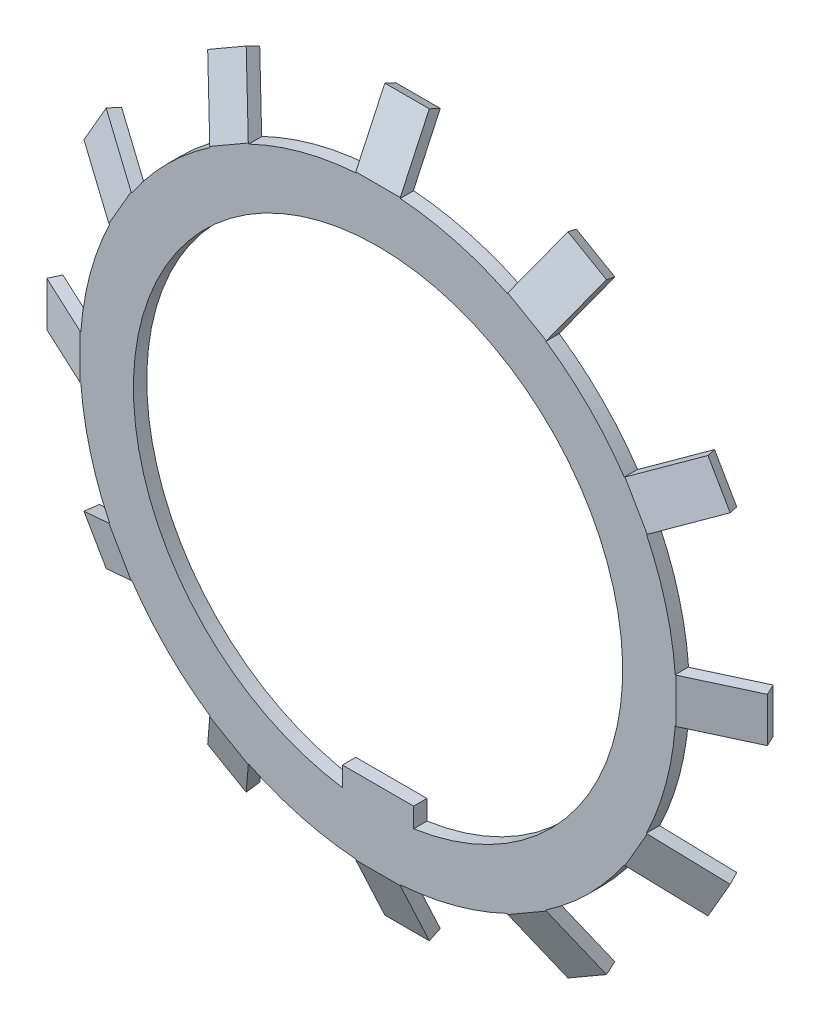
ISO-10303-21;
HEADER;
FILE_DESCRIPTION(('STEP AP214'),'2;1');
FILE_NAME('part.step','',(''),(''),'','','');
FILE_SCHEMA(('AUTOMOTIVE_DESIGN { 1 0 10303 214 1 1 1 1 }'));
ENDSEC;
DATA;
#1=APPLICATION_CONTEXT('core data for automotive mechanical design processes');
#2=APPLICATION_PROTOCOL_DEFINITION('international standard','automotive_design',2000,#1);
#3=PRODUCT_CONTEXT('',#1,'mechanical');
#4=PRODUCT('Part','Part','',(#3));
#5=PRODUCT_RELATED_PRODUCT_CATEGORY('part','',(#4));
#6=PRODUCT_DEFINITION_FORMATION('','',#4);
#7=PRODUCT_DEFINITION_CONTEXT('part definition',#1,'design');
#8=PRODUCT_DEFINITION('design','',#6,#7);
#9=PRODUCT_DEFINITION_SHAPE('','',#8);
#10=(LENGTH_UNIT() NAMED_UNIT(*) SI_UNIT(.MILLI.,.METRE.));
#11=(NAMED_UNIT(*) PLANE_ANGLE_UNIT() SI_UNIT($,.RADIAN.));
#12=(NAMED_UNIT(*) SI_UNIT($,.STERADIAN.) SOLID_ANGLE_UNIT());
#13=UNCERTAINTY_MEASURE_WITH_UNIT(LENGTH_MEASURE(1.E-05),#10,'distance_accuracy_value','');
#14=(GEOMETRIC_REPRESENTATION_CONTEXT(3) GLOBAL_UNCERTAINTY_ASSIGNED_CONTEXT((#13)) GLOBAL_UNIT_ASSIGNED_CONTEXT((#10,
#11,#12)) REPRESENTATION_CONTEXT('',''));
#15=CARTESIAN_POINT('',(0.,0.,0.));
#16=DIRECTION('',(0.,0.,1.));
#17=DIRECTION('',(1.,0.,0.));
#18=AXIS2_PLACEMENT_3D('',#15,#16,#17);
#19=CARTESIAN_POINT('',(0.,0.,1.5));
#20=DIRECTION('',(0.,0.,-1.));
#21=DIRECTION('',(-1.,0.,0.));
#22=AXIS2_PLACEMENT_3D('',#19,#20,#21);
#23=CYLINDRICAL_SURFACE('',#22,33.5);
#24=DIRECTION('',(0.,0.,-1.));
#25=VECTOR('',#24,1.);
#26=CARTESIAN_POINT('',(30.180952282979,14.5382295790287,1.5));
#27=LINE('',#26,#25);
#28=CARTESIAN_POINT('',(30.180952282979,14.5382295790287,1.5));
#29=VERTEX_POINT('',#28);
#30=CARTESIAN_POINT('',(30.180952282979,14.5382295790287,0.));
#31=VERTEX_POINT('',#30);
#32=EDGE_CURVE('E468',#29,#31,#27,.T.);
#33=ORIENTED_EDGE('',*,*,#32,.F.);
#34=CARTESIAN_POINT('',(0.,0.,1.5));
#35=DIRECTION('',(0.,0.,1.));
#36=DIRECTION('',(1.,0.,0.));
#37=AXIS2_PLACEMENT_3D('',#34,#35,#36);
#38=CIRCLE('',#37,33.5);
#39=CARTESIAN_POINT('',(33.4065861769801,2.5,1.5));
#40=VERTEX_POINT('',#39);
#41=EDGE_CURVE('E933',#40,#29,#38,.T.);
#42=ORIENTED_EDGE('',*,*,#41,.F.);
#43=DIRECTION('',(0.,0.,-1.));
#44=VECTOR('',#43,1.);
#45=CARTESIAN_POINT('',(33.4065861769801,2.5,1.5));
#46=LINE('',#45,#44);
#47=CARTESIAN_POINT('',(33.4065861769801,2.5,0.));
#48=VERTEX_POINT('',#47);
#49=EDGE_CURVE('E1437',#40,#48,#46,.T.);
#50=ORIENTED_EDGE('',*,*,#49,.T.);
#51=CARTESIAN_POINT('',(0.,0.,0.));
#52=DIRECTION('',(0.,0.,1.));
#53=DIRECTION('',(1.,0.,0.));
#54=AXIS2_PLACEMENT_3D('',#51,#52,#53);
#55=CIRCLE('',#54,33.5);
#56=EDGE_CURVE('E1429',#48,#31,#55,.T.);
#57=ORIENTED_EDGE('',*,*,#56,.T.);
#58=EDGE_LOOP('',(#33,#42,#50,#57));
#59=FACE_BOUND('',#58,.T.);
#60=ADVANCED_FACE('F445',(#59),#23,.T.);
#61=CARTESIAN_POINT('',(27.6809522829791,18.8683565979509,1.5));
#62=VERTEX_POINT('',#61);
#63=CARTESIAN_POINT('',(18.8683565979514,27.6809522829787,1.5));
#64=VERTEX_POINT('',#63);
#65=EDGE_CURVE('E460',#62,#64,#38,.T.);
#66=ORIENTED_EDGE('',*,*,#65,.F.);
#67=DIRECTION('',(0.,0.,-1.));
#68=VECTOR('',#67,1.);
#69=CARTESIAN_POINT('',(27.6809522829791,18.8683565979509,1.5));
#70=LINE('',#69,#68);
#71=CARTESIAN_POINT('',(27.6809522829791,18.8683565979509,0.));
#72=VERTEX_POINT('',#71);
#73=EDGE_CURVE('E967',#62,#72,#70,.T.);
#74=ORIENTED_EDGE('',*,*,#73,.T.);
#75=CARTESIAN_POINT('',(18.8683565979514,27.6809522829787,0.));
#76=VERTEX_POINT('',#75);
#77=EDGE_CURVE('E1432',#72,#76,#55,.T.);
#78=ORIENTED_EDGE('',*,*,#77,.T.);
#79=DIRECTION('',(0.,0.,-1.));
#80=VECTOR('',#79,1.);
#81=CARTESIAN_POINT('',(18.8683565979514,27.6809522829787,1.5));
#82=LINE('',#81,#80);
#83=EDGE_CURVE('E1004',#64,#76,#82,.T.);
#84=ORIENTED_EDGE('',*,*,#83,.F.);
#85=EDGE_LOOP('',(#66,#74,#78,#84));
#86=FACE_BOUND('',#85,.T.);
#87=ADVANCED_FACE('F1516',(#86),#23,.T.);
#88=CARTESIAN_POINT('',(14.5382295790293,30.1809522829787,1.5));
#89=VERTEX_POINT('',#88);
#90=CARTESIAN_POINT('',(2.50000000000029,33.4065861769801,1.5));
#91=VERTEX_POINT('',#90);
#92=EDGE_CURVE('E1515',#89,#91,#38,.T.);
#93=ORIENTED_EDGE('',*,*,#92,.F.);
#94=DIRECTION('',(0.,0.,-1.));
#95=VECTOR('',#94,1.);
#96=CARTESIAN_POINT('',(14.5382295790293,30.1809522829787,1.5));
#97=LINE('',#96,#95);
#98=CARTESIAN_POINT('',(14.5382295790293,30.1809522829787,0.));
#99=VERTEX_POINT('',#98);
#100=EDGE_CURVE('E1007',#89,#99,#97,.T.);
#101=ORIENTED_EDGE('',*,*,#100,.T.);
#102=CARTESIAN_POINT('',(2.50000000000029,33.4065861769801,0.));
#103=VERTEX_POINT('',#102);
#104=EDGE_CURVE('E1544',#99,#103,#55,.T.);
#105=ORIENTED_EDGE('',*,*,#104,.T.);
#106=DIRECTION('',(0.,0.,-1.));
#107=VECTOR('',#106,1.);
#108=CARTESIAN_POINT('',(2.50000000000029,33.4065861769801,1.5));
#109=LINE('',#108,#107);
#110=EDGE_CURVE('E1044',#91,#103,#109,.T.);
#111=ORIENTED_EDGE('',*,*,#110,.F.);
#112=EDGE_LOOP('',(#93,#101,#105,#111));
#113=FACE_BOUND('',#112,.T.);
#114=ADVANCED_FACE('F1542',(#113),#23,.T.);
#115=CARTESIAN_POINT('',(-2.49999999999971,33.4065861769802,1.5));
#116=VERTEX_POINT('',#115);
#117=CARTESIAN_POINT('',(-14.5382295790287,30.180952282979,1.5));
#118=VERTEX_POINT('',#117);
#119=EDGE_CURVE('E1541',#116,#118,#38,.T.);
#120=ORIENTED_EDGE('',*,*,#119,.F.);
#121=DIRECTION('',(0.,0.,-1.));
#122=VECTOR('',#121,1.);
#123=CARTESIAN_POINT('',(-2.49999999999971,33.4065861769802,1.5));
#124=LINE('',#123,#122);
#125=CARTESIAN_POINT('',(-2.49999999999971,33.4065861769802,0.));
#126=VERTEX_POINT('',#125);
#127=EDGE_CURVE('E1047',#116,#126,#124,.T.);
#128=ORIENTED_EDGE('',*,*,#127,.T.);
#129=CARTESIAN_POINT('',(-14.5382295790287,30.180952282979,0.));
#130=VERTEX_POINT('',#129);
#131=EDGE_CURVE('E1572',#126,#130,#55,.T.);
#132=ORIENTED_EDGE('',*,*,#131,.T.);
#133=DIRECTION('',(0.,0.,-1.));
#134=VECTOR('',#133,1.);
#135=CARTESIAN_POINT('',(-14.5382295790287,30.180952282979,1.5));
#136=LINE('',#135,#134);
#137=EDGE_CURVE('E1084',#118,#130,#136,.T.);
#138=ORIENTED_EDGE('',*,*,#137,.F.);
#139=EDGE_LOOP('',(#120,#128,#132,#138));
#140=FACE_BOUND('',#139,.T.);
#141=ADVANCED_FACE('F1570',(#140),#23,.T.);
#142=CARTESIAN_POINT('',(-18.868356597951,27.680952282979,1.5));
#143=VERTEX_POINT('',#142);
#144=CARTESIAN_POINT('',(-27.6809522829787,18.8683565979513,1.5));
#145=VERTEX_POINT('',#144);
#146=EDGE_CURVE('E1569',#143,#145,#38,.T.);
#147=ORIENTED_EDGE('',*,*,#146,.F.);
#148=DIRECTION('',(0.,0.,-1.));
#149=VECTOR('',#148,1.);
#150=CARTESIAN_POINT('',(-18.868356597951,27.680952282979,1.5));
#151=LINE('',#150,#149);
#152=CARTESIAN_POINT('',(-18.868356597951,27.680952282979,0.));
#153=VERTEX_POINT('',#152);
#154=EDGE_CURVE('E1087',#143,#153,#151,.T.);
#155=ORIENTED_EDGE('',*,*,#154,.T.);
#156=CARTESIAN_POINT('',(-27.6809522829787,18.8683565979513,0.));
#157=VERTEX_POINT('',#156);
#158=EDGE_CURVE('E1600',#153,#157,#55,.T.);
#159=ORIENTED_EDGE('',*,*,#158,.T.);
#160=DIRECTION('',(0.,0.,-1.));
#161=VECTOR('',#160,1.);
#162=CARTESIAN_POINT('',(-27.6809522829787,18.8683565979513,1.5));
#163=LINE('',#162,#161);
#164=EDGE_CURVE('E1124',#145,#157,#163,.T.);
#165=ORIENTED_EDGE('',*,*,#164,.F.);
#166=EDGE_LOOP('',(#147,#155,#159,#165));
#167=FACE_BOUND('',#166,.T.);
#168=ADVANCED_FACE('F1598',(#167),#23,.T.);
#169=CARTESIAN_POINT('',(-30.1809522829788,14.5382295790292,1.5));
#170=VERTEX_POINT('',#169);
#171=CARTESIAN_POINT('',(-33.4065861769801,2.50000000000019,1.5));
#172=VERTEX_POINT('',#171);
#173=EDGE_CURVE('E1597',#170,#172,#38,.T.);
#174=ORIENTED_EDGE('',*,*,#173,.F.);
#175=DIRECTION('',(0.,0.,-1.));
#176=VECTOR('',#175,1.);
#177=CARTESIAN_POINT('',(-30.1809522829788,14.5382295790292,1.5));
#178=LINE('',#177,#176);
#179=CARTESIAN_POINT('',(-30.1809522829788,14.5382295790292,0.));
#180=VERTEX_POINT('',#179);
#181=EDGE_CURVE('E1127',#170,#180,#178,.T.);
#182=ORIENTED_EDGE('',*,*,#181,.T.);
#183=CARTESIAN_POINT('',(-33.4065861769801,2.50000000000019,0.));
#184=VERTEX_POINT('',#183);
#185=EDGE_CURVE('E1628',#180,#184,#55,.T.);
#186=ORIENTED_EDGE('',*,*,#185,.T.);
#187=DIRECTION('',(0.,0.,-1.));
#188=VECTOR('',#187,1.);
#189=CARTESIAN_POINT('',(-33.4065861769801,2.50000000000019,1.5));
#190=LINE('',#189,#188);
#191=EDGE_CURVE('E1164',#172,#184,#190,.T.);
#192=ORIENTED_EDGE('',*,*,#191,.F.);
#193=EDGE_LOOP('',(#174,#182,#186,#192));
#194=FACE_BOUND('',#193,.T.);
#195=ADVANCED_FACE('F1626',(#194),#23,.T.);
#196=CARTESIAN_POINT('',(-33.4065861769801,-2.49999999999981,1.5));
#197=VERTEX_POINT('',#196);
#198=CARTESIAN_POINT('',(-30.1809522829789,-14.5382295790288,1.5));
#199=VERTEX_POINT('',#198);
#200=EDGE_CURVE('E1625',#197,#199,#38,.T.);
#201=ORIENTED_EDGE('',*,*,#200,.F.);
#202=DIRECTION('',(0.,0.,-1.));
#203=VECTOR('',#202,1.);
#204=CARTESIAN_POINT('',(-33.4065861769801,-2.49999999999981,1.5));
#205=LINE('',#204,#203);
#206=CARTESIAN_POINT('',(-33.4065861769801,-2.49999999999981,0.));
#207=VERTEX_POINT('',#206);
#208=EDGE_CURVE('E1167',#197,#207,#205,.T.);
#209=ORIENTED_EDGE('',*,*,#208,.T.);
#210=CARTESIAN_POINT('',(-30.1809522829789,-14.5382295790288,0.));
#211=VERTEX_POINT('',#210);
#212=EDGE_CURVE('E1656',#207,#211,#55,.T.);
#213=ORIENTED_EDGE('',*,*,#212,.T.);
#214=DIRECTION('',(0.,0.,-1.));
#215=VECTOR('',#214,1.);
#216=CARTESIAN_POINT('',(-30.1809522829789,-14.5382295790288,1.5));
#217=LINE('',#216,#215);
#218=EDGE_CURVE('E1204',#199,#211,#217,.T.);
#219=ORIENTED_EDGE('',*,*,#218,.F.);
#220=EDGE_LOOP('',(#201,#209,#213,#219));
#221=FACE_BOUND('',#220,.T.);
#222=ADVANCED_FACE('F1654',(#221),#23,.T.);
#223=CARTESIAN_POINT('',(-27.680952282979,-18.868356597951,1.5));
#224=VERTEX_POINT('',#223);
#225=CARTESIAN_POINT('',(-18.8683565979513,-27.6809522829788,1.5));
#226=VERTEX_POINT('',#225);
#227=EDGE_CURVE('E1653',#224,#226,#38,.T.);
#228=ORIENTED_EDGE('',*,*,#227,.F.);
#229=DIRECTION('',(0.,0.,-1.));
#230=VECTOR('',#229,1.);
#231=CARTESIAN_POINT('',(-27.680952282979,-18.868356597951,1.5));
#232=LINE('',#231,#230);
#233=CARTESIAN_POINT('',(-27.680952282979,-18.868356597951,0.));
#234=VERTEX_POINT('',#233);
#235=EDGE_CURVE('E1207',#224,#234,#232,.T.);
#236=ORIENTED_EDGE('',*,*,#235,.T.);
#237=CARTESIAN_POINT('',(-18.8683565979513,-27.6809522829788,0.));
#238=VERTEX_POINT('',#237);
#239=EDGE_CURVE('E1683',#234,#238,#55,.T.);
#240=ORIENTED_EDGE('',*,*,#239,.T.);
#241=DIRECTION('',(0.,0.,-1.));
#242=VECTOR('',#241,1.);
#243=CARTESIAN_POINT('',(-18.8683565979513,-27.6809522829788,1.5));
#244=LINE('',#243,#242);
#245=EDGE_CURVE('E1244',#226,#238,#244,.T.);
#246=ORIENTED_EDGE('',*,*,#245,.F.);
#247=EDGE_LOOP('',(#228,#236,#240,#246));
#248=FACE_BOUND('',#247,.T.);
#249=ADVANCED_FACE('F1681',(#248),#23,.T.);
#250=CARTESIAN_POINT('',(-14.5382295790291,-30.1809522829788,1.5));
#251=VERTEX_POINT('',#250);
#252=CARTESIAN_POINT('',(-2.50000000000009,-33.4065861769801,1.5));
#253=VERTEX_POINT('',#252);
#254=EDGE_CURVE('E1474',#251,#253,#38,.T.);
#255=ORIENTED_EDGE('',*,*,#254,.F.);
#256=DIRECTION('',(0.,0.,-1.));
#257=VECTOR('',#256,1.);
#258=CARTESIAN_POINT('',(-14.5382295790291,-30.1809522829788,1.5));
#259=LINE('',#258,#257);
#260=CARTESIAN_POINT('',(-14.5382295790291,-30.1809522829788,0.));
#261=VERTEX_POINT('',#260);
#262=EDGE_CURVE('E1247',#251,#261,#259,.T.);
#263=ORIENTED_EDGE('',*,*,#262,.T.);
#264=CARTESIAN_POINT('',(-2.50000000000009,-33.4065861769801,0.));
#265=VERTEX_POINT('',#264);
#266=EDGE_CURVE('E1710',#261,#265,#55,.T.);
#267=ORIENTED_EDGE('',*,*,#266,.T.);
#268=DIRECTION('',(0.,0.,-1.));
#269=VECTOR('',#268,1.);
#270=CARTESIAN_POINT('',(-2.50000000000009,-33.4065861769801,1.5));
#271=LINE('',#270,#269);
#272=EDGE_CURVE('E1284',#253,#265,#271,.T.);
#273=ORIENTED_EDGE('',*,*,#272,.F.);
#274=EDGE_LOOP('',(#255,#263,#267,#273));
#275=FACE_BOUND('',#274,.T.);
#276=ADVANCED_FACE('F1708',(#275),#23,.T.);
#277=CARTESIAN_POINT('',(2.49999999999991,-33.4065861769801,1.5));
#278=VERTEX_POINT('',#277);
#279=CARTESIAN_POINT('',(14.5382295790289,-30.1809522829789,1.5));
#280=VERTEX_POINT('',#279);
#281=EDGE_CURVE('E1473',#278,#280,#38,.T.);
#282=ORIENTED_EDGE('',*,*,#281,.F.);
#283=DIRECTION('',(0.,0.,-1.));
#284=VECTOR('',#283,1.);
#285=CARTESIAN_POINT('',(2.49999999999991,-33.4065861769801,1.5));
#286=LINE('',#285,#284);
#287=CARTESIAN_POINT('',(2.49999999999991,-33.4065861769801,0.));
#288=VERTEX_POINT('',#287);
#289=EDGE_CURVE('E1287',#278,#288,#286,.T.);
#290=ORIENTED_EDGE('',*,*,#289,.T.);
#291=CARTESIAN_POINT('',(14.5382295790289,-30.1809522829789,0.));
#292=VERTEX_POINT('',#291);
#293=EDGE_CURVE('E1736',#288,#292,#55,.T.);
#294=ORIENTED_EDGE('',*,*,#293,.T.);
#295=DIRECTION('',(0.,0.,-1.));
#296=VECTOR('',#295,1.);
#297=CARTESIAN_POINT('',(14.5382295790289,-30.1809522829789,1.5));
#298=LINE('',#297,#296);
#299=EDGE_CURVE('E1324',#280,#292,#298,.T.);
#300=ORIENTED_EDGE('',*,*,#299,.F.);
#301=EDGE_LOOP('',(#282,#290,#294,#300));
#302=FACE_BOUND('',#301,.T.);
#303=ADVANCED_FACE('F1734',(#302),#23,.T.);
#304=CARTESIAN_POINT('',(18.8683565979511,-27.6809522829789,1.5));
#305=VERTEX_POINT('',#304);
#306=CARTESIAN_POINT('',(27.6809522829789,-18.8683565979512,1.5));
#307=VERTEX_POINT('',#306);
#308=EDGE_CURVE('E1470',#305,#307,#38,.T.);
#309=ORIENTED_EDGE('',*,*,#308,.F.);
#310=DIRECTION('',(0.,0.,-1.));
#311=VECTOR('',#310,1.);
#312=CARTESIAN_POINT('',(18.8683565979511,-27.6809522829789,1.5));
#313=LINE('',#312,#311);
#314=CARTESIAN_POINT('',(18.8683565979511,-27.6809522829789,0.));
#315=VERTEX_POINT('',#314);
#316=EDGE_CURVE('E1327',#305,#315,#313,.T.);
#317=ORIENTED_EDGE('',*,*,#316,.T.);
#318=CARTESIAN_POINT('',(27.6809522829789,-18.8683565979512,0.));
#319=VERTEX_POINT('',#318);
#320=EDGE_CURVE('E1452',#315,#319,#55,.T.);
#321=ORIENTED_EDGE('',*,*,#320,.T.);
#322=DIRECTION('',(0.,0.,-1.));
#323=VECTOR('',#322,1.);
#324=CARTESIAN_POINT('',(27.6809522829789,-18.8683565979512,1.5));
#325=LINE('',#324,#323);
#326=EDGE_CURVE('E453',#307,#319,#325,.T.);
#327=ORIENTED_EDGE('',*,*,#326,.F.);
#328=EDGE_LOOP('',(#309,#317,#321,#327));
#329=FACE_BOUND('',#328,.T.);
#330=ADVANCED_FACE('F1753',(#329),#23,.T.);
#331=CARTESIAN_POINT('',(0.,0.,1.5));
#332=DIRECTION('',(0.,0.,1.));
#333=DIRECTION('',(1.,0.,0.));
#334=AXIS2_PLACEMENT_3D('',#331,#332,#333);
#335=PLANE('',#334);
#336=DIRECTION('',(0.,1.,0.));
#337=VECTOR('',#336,1.);
#338=CARTESIAN_POINT('',(-4.,-27.2075357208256,1.5));
#339=LINE('',#338,#337);
#340=CARTESIAN_POINT('',(-4.,-27.2075357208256,1.5));
#341=VERTEX_POINT('',#340);
#342=CARTESIAN_POINT('',(-4.,-25.,1.5));
#343=VERTEX_POINT('',#342);
#344=EDGE_CURVE('E1411',#341,#343,#339,.T.);
#345=ORIENTED_EDGE('',*,*,#344,.F.);
#346=CARTESIAN_POINT('',(0.,0.,1.5));
#347=DIRECTION('',(0.,0.,1.));
#348=DIRECTION('',(1.,0.,0.));
#349=AXIS2_PLACEMENT_3D('',#346,#347,#348);
#350=CIRCLE('',#349,27.5);
#351=CARTESIAN_POINT('',(4.,-27.2075357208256,1.5));
#352=VERTEX_POINT('',#351);
#353=EDGE_CURVE('E1409',#352,#341,#350,.T.);
#354=ORIENTED_EDGE('',*,*,#353,.F.);
#355=DIRECTION('',(0.,-1.,0.));
#356=VECTOR('',#355,1.);
#357=CARTESIAN_POINT('',(4.,-25.,1.5));
#358=LINE('',#357,#356);
#359=CARTESIAN_POINT('',(4.,-25.,1.5));
#360=VERTEX_POINT('',#359);
#361=EDGE_CURVE('E1416',#360,#352,#358,.T.);
#362=ORIENTED_EDGE('',*,*,#361,.F.);
#363=DIRECTION('',(1.,0.,0.));
#364=VECTOR('',#363,1.);
#365=CARTESIAN_POINT('',(-4.,-25.,1.5));
#366=LINE('',#365,#364);
#367=EDGE_CURVE('E1413',#343,#360,#366,.T.);
#368=ORIENTED_EDGE('',*,*,#367,.F.);
#369=EDGE_LOOP('',(#345,#354,#362,#368));
#370=FACE_BOUND('',#369,.T.);
#371=DIRECTION('',(0.866025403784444,0.499999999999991,0.));
#372=VECTOR('',#371,1.);
#373=CARTESIAN_POINT('',(30.2618510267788,14.5849364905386,1.5));
#374=LINE('',#373,#372);
#375=CARTESIAN_POINT('',(30.2618510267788,14.5849364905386,1.5));
#376=VERTEX_POINT('',#375);
#377=EDGE_CURVE('E930',#29,#376,#374,.T.);
#378=ORIENTED_EDGE('',*,*,#377,.T.);
#379=DIRECTION('',(0.499999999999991,-0.866025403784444,0.));
#380=VECTOR('',#379,1.);
#381=CARTESIAN_POINT('',(27.7618510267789,18.9150635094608,1.5));
#382=LINE('',#381,#380);
#383=CARTESIAN_POINT('',(27.7618510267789,18.9150635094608,1.5));
#384=VERTEX_POINT('',#383);
#385=EDGE_CURVE('E917',#384,#376,#382,.T.);
#386=ORIENTED_EDGE('',*,*,#385,.F.);
#387=DIRECTION('',(0.866025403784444,0.499999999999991,0.));
#388=VECTOR('',#387,1.);
#389=CARTESIAN_POINT('',(27.7618510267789,18.9150635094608,1.5));
#390=LINE('',#389,#388);
#391=EDGE_CURVE('E949',#62,#384,#390,.T.);
#392=ORIENTED_EDGE('',*,*,#391,.F.);
#393=ORIENTED_EDGE('',*,*,#65,.T.);
#394=DIRECTION('',(0.500000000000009,0.866025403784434,0.));
#395=VECTOR('',#394,1.);
#396=CARTESIAN_POINT('',(18.9150635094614,27.7618510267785,1.5));
#397=LINE('',#396,#395);
#398=CARTESIAN_POINT('',(18.9150635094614,27.7618510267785,1.5));
#399=VERTEX_POINT('',#398);
#400=EDGE_CURVE('E969',#64,#399,#397,.T.);
#401=ORIENTED_EDGE('',*,*,#400,.T.);
#402=DIRECTION('',(0.866025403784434,-0.500000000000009,0.));
#403=VECTOR('',#402,1.);
#404=CARTESIAN_POINT('',(14.5849364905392,30.2618510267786,1.5));
#405=LINE('',#404,#403);
#406=CARTESIAN_POINT('',(14.5849364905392,30.2618510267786,1.5));
#407=VERTEX_POINT('',#406);
#408=EDGE_CURVE('E1002',#407,#399,#405,.T.);
#409=ORIENTED_EDGE('',*,*,#408,.F.);
#410=DIRECTION('',(0.500000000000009,0.866025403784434,0.));
#411=VECTOR('',#410,1.);
#412=CARTESIAN_POINT('',(14.5849364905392,30.2618510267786,1.5));
#413=LINE('',#412,#411);
#414=EDGE_CURVE('E982',#89,#407,#413,.T.);
#415=ORIENTED_EDGE('',*,*,#414,.F.);
#416=ORIENTED_EDGE('',*,*,#92,.T.);
#417=DIRECTION('',(0.,1.,0.));
#418=VECTOR('',#417,1.);
#419=CARTESIAN_POINT('',(2.50000000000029,33.5,1.5));
#420=LINE('',#419,#418);
#421=CARTESIAN_POINT('',(2.50000000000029,33.5,1.5));
#422=VERTEX_POINT('',#421);
#423=EDGE_CURVE('E1009',#91,#422,#420,.T.);
#424=ORIENTED_EDGE('',*,*,#423,.T.);
#425=DIRECTION('',(1.,0.,0.));
#426=VECTOR('',#425,1.);
#427=CARTESIAN_POINT('',(-2.49999999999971,33.5,1.5));
#428=LINE('',#427,#426);
#429=CARTESIAN_POINT('',(-2.49999999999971,33.5,1.5));
#430=VERTEX_POINT('',#429);
#431=EDGE_CURVE('E1042',#430,#422,#428,.T.);
#432=ORIENTED_EDGE('',*,*,#431,.F.);
#433=DIRECTION('',(0.,1.,0.));
#434=VECTOR('',#433,1.);
#435=CARTESIAN_POINT('',(-2.49999999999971,33.5,1.5));
#436=LINE('',#435,#434);
#437=EDGE_CURVE('E1022',#116,#430,#436,.T.);
#438=ORIENTED_EDGE('',*,*,#437,.F.);
#439=ORIENTED_EDGE('',*,*,#119,.T.);
#440=DIRECTION('',(-0.499999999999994,0.866025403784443,0.));
#441=VECTOR('',#440,1.);
#442=CARTESIAN_POINT('',(-14.5849364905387,30.2618510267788,1.5));
#443=LINE('',#442,#441);
#444=CARTESIAN_POINT('',(-14.5849364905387,30.2618510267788,1.5));
#445=VERTEX_POINT('',#444);
#446=EDGE_CURVE('E1049',#118,#445,#443,.T.);
#447=ORIENTED_EDGE('',*,*,#446,.T.);
#448=DIRECTION('',(0.866025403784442,0.499999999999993,0.));
#449=VECTOR('',#448,1.);
#450=CARTESIAN_POINT('',(-18.9150635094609,27.7618510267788,1.5));
#451=LINE('',#450,#449);
#452=CARTESIAN_POINT('',(-18.9150635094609,27.7618510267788,1.5));
#453=VERTEX_POINT('',#452);
#454=EDGE_CURVE('E1082',#453,#445,#451,.T.);
#455=ORIENTED_EDGE('',*,*,#454,.F.);
#456=DIRECTION('',(-0.499999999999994,0.866025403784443,0.));
#457=VECTOR('',#456,1.);
#458=CARTESIAN_POINT('',(-18.9150635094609,27.7618510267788,1.5));
#459=LINE('',#458,#457);
#460=EDGE_CURVE('E1062',#143,#453,#459,.T.);
#461=ORIENTED_EDGE('',*,*,#460,.F.);
#462=ORIENTED_EDGE('',*,*,#146,.T.);
#463=DIRECTION('',(-0.866025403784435,0.500000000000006,0.));
#464=VECTOR('',#463,1.);
#465=CARTESIAN_POINT('',(-27.7618510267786,18.9150635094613,1.5));
#466=LINE('',#465,#464);
#467=CARTESIAN_POINT('',(-27.7618510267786,18.9150635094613,1.5));
#468=VERTEX_POINT('',#467);
#469=EDGE_CURVE('E1089',#145,#468,#466,.T.);
#470=ORIENTED_EDGE('',*,*,#469,.T.);
#471=DIRECTION('',(0.500000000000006,0.866025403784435,0.));
#472=VECTOR('',#471,1.);
#473=CARTESIAN_POINT('',(-30.2618510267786,14.5849364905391,1.5));
#474=LINE('',#473,#472);
#475=CARTESIAN_POINT('',(-30.2618510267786,14.5849364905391,1.5));
#476=VERTEX_POINT('',#475);
#477=EDGE_CURVE('E1122',#476,#468,#474,.T.);
#478=ORIENTED_EDGE('',*,*,#477,.F.);
#479=DIRECTION('',(-0.866025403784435,0.500000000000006,0.));
#480=VECTOR('',#479,1.);
#481=CARTESIAN_POINT('',(-30.2618510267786,14.5849364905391,1.5));
#482=LINE('',#481,#480);
#483=EDGE_CURVE('E1102',#170,#476,#482,.T.);
#484=ORIENTED_EDGE('',*,*,#483,.F.);
#485=ORIENTED_EDGE('',*,*,#173,.T.);
#486=DIRECTION('',(-1.,0.,0.));
#487=VECTOR('',#486,1.);
#488=CARTESIAN_POINT('',(-33.5,2.50000000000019,1.5));
#489=LINE('',#488,#487);
#490=CARTESIAN_POINT('',(-33.5,2.50000000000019,1.5));
#491=VERTEX_POINT('',#490);
#492=EDGE_CURVE('E1129',#172,#491,#489,.T.);
#493=ORIENTED_EDGE('',*,*,#492,.T.);
#494=DIRECTION('',(0.,1.,0.));
#495=VECTOR('',#494,1.);
#496=CARTESIAN_POINT('',(-33.5,-2.49999999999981,1.5));
#497=LINE('',#496,#495);
#498=CARTESIAN_POINT('',(-33.5,-2.49999999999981,1.5));
#499=VERTEX_POINT('',#498);
#500=EDGE_CURVE('E1162',#499,#491,#497,.T.);
#501=ORIENTED_EDGE('',*,*,#500,.F.);
#502=DIRECTION('',(-1.,0.,0.));
#503=VECTOR('',#502,1.);
#504=CARTESIAN_POINT('',(-33.5,-2.49999999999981,1.5));
#505=LINE('',#504,#503);
#506=EDGE_CURVE('E1142',#197,#499,#505,.T.);
#507=ORIENTED_EDGE('',*,*,#506,.F.);
#508=ORIENTED_EDGE('',*,*,#200,.T.);
#509=DIRECTION('',(-0.866025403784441,-0.499999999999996,0.));
#510=VECTOR('',#509,1.);
#511=CARTESIAN_POINT('',(-30.2618510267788,-14.5849364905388,1.5));
#512=LINE('',#511,#510);
#513=CARTESIAN_POINT('',(-30.2618510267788,-14.5849364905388,1.5));
#514=VERTEX_POINT('',#513);
#515=EDGE_CURVE('E1169',#199,#514,#512,.T.);
#516=ORIENTED_EDGE('',*,*,#515,.T.);
#517=DIRECTION('',(-0.499999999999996,0.866025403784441,0.));
#518=VECTOR('',#517,1.);
#519=CARTESIAN_POINT('',(-27.7618510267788,-18.915063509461,1.5));
#520=LINE('',#519,#518);
#521=CARTESIAN_POINT('',(-27.7618510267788,-18.915063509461,1.5));
#522=VERTEX_POINT('',#521);
#523=EDGE_CURVE('E1202',#522,#514,#520,.T.);
#524=ORIENTED_EDGE('',*,*,#523,.F.);
#525=DIRECTION('',(-0.866025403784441,-0.499999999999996,0.));
#526=VECTOR('',#525,1.);
#527=CARTESIAN_POINT('',(-27.7618510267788,-18.915063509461,1.5));
#528=LINE('',#527,#526);
#529=EDGE_CURVE('E1182',#224,#522,#528,.T.);
#530=ORIENTED_EDGE('',*,*,#529,.F.);
#531=ORIENTED_EDGE('',*,*,#227,.T.);
#532=DIRECTION('',(-0.500000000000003,-0.866025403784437,0.));
#533=VECTOR('',#532,1.);
#534=CARTESIAN_POINT('',(-18.9150635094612,-27.7618510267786,1.5));
#535=LINE('',#534,#533);
#536=CARTESIAN_POINT('',(-18.9150635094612,-27.7618510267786,1.5));
#537=VERTEX_POINT('',#536);
#538=EDGE_CURVE('E1209',#226,#537,#535,.T.);
#539=ORIENTED_EDGE('',*,*,#538,.T.);
#540=DIRECTION('',(-0.866025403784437,0.500000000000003,0.));
#541=VECTOR('',#540,1.);
#542=CARTESIAN_POINT('',(-14.584936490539,-30.2618510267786,1.5));
#543=LINE('',#542,#541);
#544=CARTESIAN_POINT('',(-14.584936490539,-30.2618510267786,1.5));
#545=VERTEX_POINT('',#544);
#546=EDGE_CURVE('E1242',#545,#537,#543,.T.);
#547=ORIENTED_EDGE('',*,*,#546,.F.);
#548=DIRECTION('',(-0.500000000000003,-0.866025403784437,0.));
#549=VECTOR('',#548,1.);
#550=CARTESIAN_POINT('',(-14.584936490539,-30.2618510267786,1.5));
#551=LINE('',#550,#549);
#552=EDGE_CURVE('E1222',#251,#545,#551,.T.);
#553=ORIENTED_EDGE('',*,*,#552,.F.);
#554=ORIENTED_EDGE('',*,*,#254,.T.);
#555=DIRECTION('',(0.,-1.,0.));
#556=VECTOR('',#555,1.);
#557=CARTESIAN_POINT('',(-2.50000000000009,-33.5,1.5));
#558=LINE('',#557,#556);
#559=CARTESIAN_POINT('',(-2.50000000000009,-33.5,1.5));
#560=VERTEX_POINT('',#559);
#561=EDGE_CURVE('E1249',#253,#560,#558,.T.);
#562=ORIENTED_EDGE('',*,*,#561,.T.);
#563=DIRECTION('',(-1.,0.,0.));
#564=VECTOR('',#563,1.);
#565=CARTESIAN_POINT('',(2.49999999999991,-33.5,1.5));
#566=LINE('',#565,#564);
#567=CARTESIAN_POINT('',(2.49999999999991,-33.5,1.5));
#568=VERTEX_POINT('',#567);
#569=EDGE_CURVE('E1282',#568,#560,#566,.T.);
#570=ORIENTED_EDGE('',*,*,#569,.F.);
#571=DIRECTION('',(0.,-1.,0.));
#572=VECTOR('',#571,1.);
#573=CARTESIAN_POINT('',(2.49999999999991,-33.5,1.5));
#574=LINE('',#573,#572);
#575=EDGE_CURVE('E1262',#278,#568,#574,.T.);
#576=ORIENTED_EDGE('',*,*,#575,.F.);
#577=ORIENTED_EDGE('',*,*,#281,.T.);
#578=DIRECTION('',(0.499999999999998,-0.86602540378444,0.));
#579=VECTOR('',#578,1.);
#580=CARTESIAN_POINT('',(14.5849364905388,-30.2618510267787,1.5));
#581=LINE('',#580,#579);
#582=CARTESIAN_POINT('',(14.5849364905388,-30.2618510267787,1.5));
#583=VERTEX_POINT('',#582);
#584=EDGE_CURVE('E1289',#280,#583,#581,.T.);
#585=ORIENTED_EDGE('',*,*,#584,.T.);
#586=DIRECTION('',(-0.86602540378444,-0.499999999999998,0.));
#587=VECTOR('',#586,1.);
#588=CARTESIAN_POINT('',(18.915063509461,-27.7618510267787,1.5));
#589=LINE('',#588,#587);
#590=CARTESIAN_POINT('',(18.915063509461,-27.7618510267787,1.5));
#591=VERTEX_POINT('',#590);
#592=EDGE_CURVE('E1322',#591,#583,#589,.T.);
#593=ORIENTED_EDGE('',*,*,#592,.F.);
#594=DIRECTION('',(0.499999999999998,-0.86602540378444,0.));
#595=VECTOR('',#594,1.);
#596=CARTESIAN_POINT('',(18.915063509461,-27.7618510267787,1.5));
#597=LINE('',#596,#595);
#598=EDGE_CURVE('E1302',#305,#591,#597,.T.);
#599=ORIENTED_EDGE('',*,*,#598,.F.);
#600=ORIENTED_EDGE('',*,*,#308,.T.);
#601=DIRECTION('',(0.866025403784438,-0.500000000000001,0.));
#602=VECTOR('',#601,1.);
#603=CARTESIAN_POINT('',(27.7618510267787,-18.9150635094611,1.5));
#604=LINE('',#603,#602);
#605=CARTESIAN_POINT('',(27.7618510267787,-18.9150635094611,1.5));
#606=VERTEX_POINT('',#605);
#607=EDGE_CURVE('E1329',#307,#606,#604,.T.);
#608=ORIENTED_EDGE('',*,*,#607,.T.);
#609=DIRECTION('',(-0.500000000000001,-0.866025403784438,0.));
#610=VECTOR('',#609,1.);
#611=CARTESIAN_POINT('',(30.2618510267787,-14.5849364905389,1.5));
#612=LINE('',#611,#610);
#613=CARTESIAN_POINT('',(30.2618510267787,-14.5849364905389,1.5));
#614=VERTEX_POINT('',#613);
#615=EDGE_CURVE('E1362',#614,#606,#612,.T.);
#616=ORIENTED_EDGE('',*,*,#615,.F.);
#617=DIRECTION('',(0.866025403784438,-0.500000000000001,0.));
#618=VECTOR('',#617,1.);
#619=CARTESIAN_POINT('',(30.2618510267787,-14.5849364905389,1.5));
#620=LINE('',#619,#618);
#621=CARTESIAN_POINT('',(30.1809522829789,-14.538229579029,1.5));
#622=VERTEX_POINT('',#621);
#623=EDGE_CURVE('E1342',#622,#614,#620,.T.);
#624=ORIENTED_EDGE('',*,*,#623,.F.);
#625=CARTESIAN_POINT('',(33.4065861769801,-2.5,1.5));
#626=VERTEX_POINT('',#625);
#627=EDGE_CURVE('E1431',#622,#626,#38,.T.);
#628=ORIENTED_EDGE('',*,*,#627,.T.);
#629=DIRECTION('',(1.,0.,0.));
#630=VECTOR('',#629,1.);
#631=CARTESIAN_POINT('',(33.5,-2.5,1.5));
#632=LINE('',#631,#630);
#633=CARTESIAN_POINT('',(33.5,-2.5,1.5));
#634=VERTEX_POINT('',#633);
#635=EDGE_CURVE('E1364',#626,#634,#632,.T.);
#636=ORIENTED_EDGE('',*,*,#635,.T.);
#637=DIRECTION('',(0.,-1.,0.));
#638=VECTOR('',#637,1.);
#639=CARTESIAN_POINT('',(33.5,2.5,1.5));
#640=LINE('',#639,#638);
#641=CARTESIAN_POINT('',(33.5,2.5,1.5));
#642=VERTEX_POINT('',#641);
#643=EDGE_CURVE('E1396',#642,#634,#640,.T.);
#644=ORIENTED_EDGE('',*,*,#643,.F.);
#645=DIRECTION('',(1.,0.,0.));
#646=VECTOR('',#645,1.);
#647=CARTESIAN_POINT('',(33.5,2.5,1.5));
#648=LINE('',#647,#646);
#649=EDGE_CURVE('E1377',#40,#642,#648,.T.);
#650=ORIENTED_EDGE('',*,*,#649,.F.);
#651=ORIENTED_EDGE('',*,*,#41,.T.);
#652=EDGE_LOOP('',(#378,#386,#392,#393,#401,#409,#415,#416,#424,#432,#438,#439,#447,#455,#461,
#462,#470,#478,#484,#485,#493,#501,#507,#508,#516,#524,#530,#531,#539,#547,#553,#554,#562,#570,
#576,#577,#585,#593,#599,#600,#608,#616,#624,#628,#636,#644,#650,#651));
#653=FACE_BOUND('',#652,.T.);
#654=ADVANCED_FACE('F931',(#370,#653),#335,.T.);
#655=CARTESIAN_POINT('',(0.,0.,0.));
#656=DIRECTION('',(0.,0.,1.));
#657=DIRECTION('',(1.,0.,0.));
#658=AXIS2_PLACEMENT_3D('',#655,#656,#657);
#659=PLANE('',#658);
#660=CARTESIAN_POINT('',(0.,0.,0.));
#661=DIRECTION('',(0.,0.,1.));
#662=DIRECTION('',(1.,0.,0.));
#663=AXIS2_PLACEMENT_3D('',#660,#661,#662);
#664=CIRCLE('',#663,27.5);
#665=CARTESIAN_POINT('',(4.,-27.2075357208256,0.));
#666=VERTEX_POINT('',#665);
#667=CARTESIAN_POINT('',(-4.,-27.2075357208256,0.));
#668=VERTEX_POINT('',#667);
#669=EDGE_CURVE('E1398',#666,#668,#664,.T.);
#670=ORIENTED_EDGE('',*,*,#669,.T.);
#671=DIRECTION('',(0.,1.,0.));
#672=VECTOR('',#671,1.);
#673=CARTESIAN_POINT('',(-4.,-27.2075357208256,0.));
#674=LINE('',#673,#672);
#675=CARTESIAN_POINT('',(-4.,-25.,0.));
#676=VERTEX_POINT('',#675);
#677=EDGE_CURVE('E1400',#668,#676,#674,.T.);
#678=ORIENTED_EDGE('',*,*,#677,.T.);
#679=DIRECTION('',(1.,0.,0.));
#680=VECTOR('',#679,1.);
#681=CARTESIAN_POINT('',(-4.,-25.,0.));
#682=LINE('',#681,#680);
#683=CARTESIAN_POINT('',(4.,-25.,0.));
#684=VERTEX_POINT('',#683);
#685=EDGE_CURVE('E1403',#676,#684,#682,.T.);
#686=ORIENTED_EDGE('',*,*,#685,.T.);
#687=DIRECTION('',(0.,-1.,0.));
#688=VECTOR('',#687,1.);
#689=CARTESIAN_POINT('',(4.,-25.,0.));
#690=LINE('',#689,#688);
#691=EDGE_CURVE('E1406',#684,#666,#690,.T.);
#692=ORIENTED_EDGE('',*,*,#691,.T.);
#693=EDGE_LOOP('',(#670,#678,#686,#692));
#694=FACE_BOUND('',#693,.T.);
#695=ORIENTED_EDGE('',*,*,#77,.F.);
#696=DIRECTION('',(-0.866025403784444,-0.499999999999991,0.));
#697=VECTOR('',#696,1.);
#698=CARTESIAN_POINT('',(27.7618510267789,18.9150635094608,0.));
#699=LINE('',#698,#697);
#700=CARTESIAN_POINT('',(27.7618510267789,18.9150635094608,0.));
#701=VERTEX_POINT('',#700);
#702=EDGE_CURVE('E957',#701,#72,#699,.T.);
#703=ORIENTED_EDGE('',*,*,#702,.F.);
#704=DIRECTION('',(0.499999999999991,-0.866025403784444,0.));
#705=VECTOR('',#704,1.);
#706=CARTESIAN_POINT('',(27.7618510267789,18.9150635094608,0.));
#707=LINE('',#706,#705);
#708=CARTESIAN_POINT('',(30.2618510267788,14.5849364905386,0.));
#709=VERTEX_POINT('',#708);
#710=EDGE_CURVE('E960',#701,#709,#707,.T.);
#711=ORIENTED_EDGE('',*,*,#710,.T.);
#712=DIRECTION('',(-0.866025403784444,-0.499999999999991,0.));
#713=VECTOR('',#712,1.);
#714=CARTESIAN_POINT('',(30.2618510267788,14.5849364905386,0.));
#715=LINE('',#714,#713);
#716=EDGE_CURVE('E946',#709,#31,#715,.T.);
#717=ORIENTED_EDGE('',*,*,#716,.T.);
#718=ORIENTED_EDGE('',*,*,#56,.F.);
#719=DIRECTION('',(-1.,0.,0.));
#720=VECTOR('',#719,1.);
#721=CARTESIAN_POINT('',(33.5,2.5,0.));
#722=LINE('',#721,#720);
#723=CARTESIAN_POINT('',(33.5,2.5,0.));
#724=VERTEX_POINT('',#723);
#725=EDGE_CURVE('E1385',#724,#48,#722,.T.);
#726=ORIENTED_EDGE('',*,*,#725,.F.);
#727=DIRECTION('',(0.,-1.,0.));
#728=VECTOR('',#727,1.);
#729=CARTESIAN_POINT('',(33.5,2.5,0.));
#730=LINE('',#729,#728);
#731=CARTESIAN_POINT('',(33.5,-2.5,0.));
#732=VERTEX_POINT('',#731);
#733=EDGE_CURVE('E1388',#724,#732,#730,.T.);
#734=ORIENTED_EDGE('',*,*,#733,.T.);
#735=DIRECTION('',(-1.,0.,0.));
#736=VECTOR('',#735,1.);
#737=CARTESIAN_POINT('',(33.5,-2.5,0.));
#738=LINE('',#737,#736);
#739=CARTESIAN_POINT('',(33.4065861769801,-2.5,0.));
#740=VERTEX_POINT('',#739);
#741=EDGE_CURVE('E1374',#732,#740,#738,.T.);
#742=ORIENTED_EDGE('',*,*,#741,.T.);
#743=CARTESIAN_POINT('',(30.1809522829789,-14.538229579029,0.));
#744=VERTEX_POINT('',#743);
#745=EDGE_CURVE('E1428',#744,#740,#55,.T.);
#746=ORIENTED_EDGE('',*,*,#745,.F.);
#747=DIRECTION('',(-0.866025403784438,0.500000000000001,0.));
#748=VECTOR('',#747,1.);
#749=CARTESIAN_POINT('',(30.2618510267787,-14.5849364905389,0.));
#750=LINE('',#749,#748);
#751=CARTESIAN_POINT('',(30.2618510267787,-14.5849364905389,0.));
#752=VERTEX_POINT('',#751);
#753=EDGE_CURVE('E1351',#752,#744,#750,.T.);
#754=ORIENTED_EDGE('',*,*,#753,.F.);
#755=DIRECTION('',(-0.500000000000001,-0.866025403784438,0.));
#756=VECTOR('',#755,1.);
#757=CARTESIAN_POINT('',(30.2618510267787,-14.5849364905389,0.));
#758=LINE('',#757,#756);
#759=CARTESIAN_POINT('',(27.7618510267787,-18.9150635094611,0.));
#760=VERTEX_POINT('',#759);
#761=EDGE_CURVE('E1354',#752,#760,#758,.T.);
#762=ORIENTED_EDGE('',*,*,#761,.T.);
#763=DIRECTION('',(-0.866025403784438,0.500000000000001,0.));
#764=VECTOR('',#763,1.);
#765=CARTESIAN_POINT('',(27.7618510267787,-18.9150635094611,0.));
#766=LINE('',#765,#764);
#767=EDGE_CURVE('E1339',#760,#319,#766,.T.);
#768=ORIENTED_EDGE('',*,*,#767,.T.);
#769=ORIENTED_EDGE('',*,*,#320,.F.);
#770=DIRECTION('',(-0.499999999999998,0.86602540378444,0.));
#771=VECTOR('',#770,1.);
#772=CARTESIAN_POINT('',(18.915063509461,-27.7618510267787,0.));
#773=LINE('',#772,#771);
#774=CARTESIAN_POINT('',(18.915063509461,-27.7618510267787,0.));
#775=VERTEX_POINT('',#774);
#776=EDGE_CURVE('E1311',#775,#315,#773,.T.);
#777=ORIENTED_EDGE('',*,*,#776,.F.);
#778=DIRECTION('',(-0.86602540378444,-0.499999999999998,0.));
#779=VECTOR('',#778,1.);
#780=CARTESIAN_POINT('',(18.915063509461,-27.7618510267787,0.));
#781=LINE('',#780,#779);
#782=CARTESIAN_POINT('',(14.5849364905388,-30.2618510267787,0.));
#783=VERTEX_POINT('',#782);
#784=EDGE_CURVE('E1314',#775,#783,#781,.T.);
#785=ORIENTED_EDGE('',*,*,#784,.T.);
#786=DIRECTION('',(-0.499999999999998,0.86602540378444,0.));
#787=VECTOR('',#786,1.);
#788=CARTESIAN_POINT('',(14.5849364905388,-30.2618510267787,0.));
#789=LINE('',#788,#787);
#790=EDGE_CURVE('E1299',#783,#292,#789,.T.);
#791=ORIENTED_EDGE('',*,*,#790,.T.);
#792=ORIENTED_EDGE('',*,*,#293,.F.);
#793=DIRECTION('',(0.,1.,0.));
#794=VECTOR('',#793,1.);
#795=CARTESIAN_POINT('',(2.49999999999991,-33.5,0.));
#796=LINE('',#795,#794);
#797=CARTESIAN_POINT('',(2.49999999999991,-33.5,0.));
#798=VERTEX_POINT('',#797);
#799=EDGE_CURVE('E1271',#798,#288,#796,.T.);
#800=ORIENTED_EDGE('',*,*,#799,.F.);
#801=DIRECTION('',(-1.,0.,0.));
#802=VECTOR('',#801,1.);
#803=CARTESIAN_POINT('',(2.49999999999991,-33.5,0.));
#804=LINE('',#803,#802);
#805=CARTESIAN_POINT('',(-2.50000000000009,-33.5,0.));
#806=VERTEX_POINT('',#805);
#807=EDGE_CURVE('E1274',#798,#806,#804,.T.);
#808=ORIENTED_EDGE('',*,*,#807,.T.);
#809=DIRECTION('',(0.,1.,0.));
#810=VECTOR('',#809,1.);
#811=CARTESIAN_POINT('',(-2.50000000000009,-33.5,0.));
#812=LINE('',#811,#810);
#813=EDGE_CURVE('E1259',#806,#265,#812,.T.);
#814=ORIENTED_EDGE('',*,*,#813,.T.);
#815=ORIENTED_EDGE('',*,*,#266,.F.);
#816=DIRECTION('',(0.500000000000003,0.866025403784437,0.));
#817=VECTOR('',#816,1.);
#818=CARTESIAN_POINT('',(-14.584936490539,-30.2618510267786,0.));
#819=LINE('',#818,#817);
#820=CARTESIAN_POINT('',(-14.584936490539,-30.2618510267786,0.));
#821=VERTEX_POINT('',#820);
#822=EDGE_CURVE('E1231',#821,#261,#819,.T.);
#823=ORIENTED_EDGE('',*,*,#822,.F.);
#824=DIRECTION('',(-0.866025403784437,0.500000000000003,0.));
#825=VECTOR('',#824,1.);
#826=CARTESIAN_POINT('',(-14.584936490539,-30.2618510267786,0.));
#827=LINE('',#826,#825);
#828=CARTESIAN_POINT('',(-18.9150635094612,-27.7618510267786,0.));
#829=VERTEX_POINT('',#828);
#830=EDGE_CURVE('E1234',#821,#829,#827,.T.);
#831=ORIENTED_EDGE('',*,*,#830,.T.);
#832=DIRECTION('',(0.500000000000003,0.866025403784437,0.));
#833=VECTOR('',#832,1.);
#834=CARTESIAN_POINT('',(-18.9150635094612,-27.7618510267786,0.));
#835=LINE('',#834,#833);
#836=EDGE_CURVE('E1219',#829,#238,#835,.T.);
#837=ORIENTED_EDGE('',*,*,#836,.T.);
#838=ORIENTED_EDGE('',*,*,#239,.F.);
#839=DIRECTION('',(0.866025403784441,0.499999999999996,0.));
#840=VECTOR('',#839,1.);
#841=CARTESIAN_POINT('',(-27.7618510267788,-18.915063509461,0.));
#842=LINE('',#841,#840);
#843=CARTESIAN_POINT('',(-27.7618510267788,-18.915063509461,0.));
#844=VERTEX_POINT('',#843);
#845=EDGE_CURVE('E1191',#844,#234,#842,.T.);
#846=ORIENTED_EDGE('',*,*,#845,.F.);
#847=DIRECTION('',(-0.499999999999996,0.866025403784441,0.));
#848=VECTOR('',#847,1.);
#849=CARTESIAN_POINT('',(-27.7618510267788,-18.915063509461,0.));
#850=LINE('',#849,#848);
#851=CARTESIAN_POINT('',(-30.2618510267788,-14.5849364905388,0.));
#852=VERTEX_POINT('',#851);
#853=EDGE_CURVE('E1194',#844,#852,#850,.T.);
#854=ORIENTED_EDGE('',*,*,#853,.T.);
#855=DIRECTION('',(0.866025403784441,0.499999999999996,0.));
#856=VECTOR('',#855,1.);
#857=CARTESIAN_POINT('',(-30.2618510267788,-14.5849364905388,0.));
#858=LINE('',#857,#856);
#859=EDGE_CURVE('E1179',#852,#211,#858,.T.);
#860=ORIENTED_EDGE('',*,*,#859,.T.);
#861=ORIENTED_EDGE('',*,*,#212,.F.);
#862=DIRECTION('',(1.,0.,0.));
#863=VECTOR('',#862,1.);
#864=CARTESIAN_POINT('',(-33.5,-2.49999999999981,0.));
#865=LINE('',#864,#863);
#866=CARTESIAN_POINT('',(-33.5,-2.49999999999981,0.));
#867=VERTEX_POINT('',#866);
#868=EDGE_CURVE('E1151',#867,#207,#865,.T.);
#869=ORIENTED_EDGE('',*,*,#868,.F.);
#870=DIRECTION('',(0.,1.,0.));
#871=VECTOR('',#870,1.);
#872=CARTESIAN_POINT('',(-33.5,-2.49999999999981,0.));
#873=LINE('',#872,#871);
#874=CARTESIAN_POINT('',(-33.5,2.50000000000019,0.));
#875=VERTEX_POINT('',#874);
#876=EDGE_CURVE('E1154',#867,#875,#873,.T.);
#877=ORIENTED_EDGE('',*,*,#876,.T.);
#878=DIRECTION('',(1.,0.,0.));
#879=VECTOR('',#878,1.);
#880=CARTESIAN_POINT('',(-33.5,2.50000000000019,0.));
#881=LINE('',#880,#879);
#882=EDGE_CURVE('E1139',#875,#184,#881,.T.);
#883=ORIENTED_EDGE('',*,*,#882,.T.);
#884=ORIENTED_EDGE('',*,*,#185,.F.);
#885=DIRECTION('',(0.866025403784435,-0.500000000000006,0.));
#886=VECTOR('',#885,1.);
#887=CARTESIAN_POINT('',(-30.2618510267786,14.5849364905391,0.));
#888=LINE('',#887,#886);
#889=CARTESIAN_POINT('',(-30.2618510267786,14.5849364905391,0.));
#890=VERTEX_POINT('',#889);
#891=EDGE_CURVE('E1111',#890,#180,#888,.T.);
#892=ORIENTED_EDGE('',*,*,#891,.F.);
#893=DIRECTION('',(0.500000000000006,0.866025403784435,0.));
#894=VECTOR('',#893,1.);
#895=CARTESIAN_POINT('',(-30.2618510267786,14.5849364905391,0.));
#896=LINE('',#895,#894);
#897=CARTESIAN_POINT('',(-27.7618510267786,18.9150635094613,0.));
#898=VERTEX_POINT('',#897);
#899=EDGE_CURVE('E1114',#890,#898,#896,.T.);
#900=ORIENTED_EDGE('',*,*,#899,.T.);
#901=DIRECTION('',(0.866025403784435,-0.500000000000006,0.));
#902=VECTOR('',#901,1.);
#903=CARTESIAN_POINT('',(-27.7618510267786,18.9150635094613,0.));
#904=LINE('',#903,#902);
#905=EDGE_CURVE('E1099',#898,#157,#904,.T.);
#906=ORIENTED_EDGE('',*,*,#905,.T.);
#907=ORIENTED_EDGE('',*,*,#158,.F.);
#908=DIRECTION('',(0.499999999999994,-0.866025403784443,0.));
#909=VECTOR('',#908,1.);
#910=CARTESIAN_POINT('',(-18.9150635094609,27.7618510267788,0.));
#911=LINE('',#910,#909);
#912=CARTESIAN_POINT('',(-18.9150635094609,27.7618510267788,0.));
#913=VERTEX_POINT('',#912);
#914=EDGE_CURVE('E1071',#913,#153,#911,.T.);
#915=ORIENTED_EDGE('',*,*,#914,.F.);
#916=DIRECTION('',(0.866025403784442,0.499999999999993,0.));
#917=VECTOR('',#916,1.);
#918=CARTESIAN_POINT('',(-18.9150635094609,27.7618510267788,0.));
#919=LINE('',#918,#917);
#920=CARTESIAN_POINT('',(-14.5849364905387,30.2618510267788,0.));
#921=VERTEX_POINT('',#920);
#922=EDGE_CURVE('E1074',#913,#921,#919,.T.);
#923=ORIENTED_EDGE('',*,*,#922,.T.);
#924=DIRECTION('',(0.499999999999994,-0.866025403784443,0.));
#925=VECTOR('',#924,1.);
#926=CARTESIAN_POINT('',(-14.5849364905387,30.2618510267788,0.));
#927=LINE('',#926,#925);
#928=EDGE_CURVE('E1059',#921,#130,#927,.T.);
#929=ORIENTED_EDGE('',*,*,#928,.T.);
#930=ORIENTED_EDGE('',*,*,#131,.F.);
#931=DIRECTION('',(0.,-1.,0.));
#932=VECTOR('',#931,1.);
#933=CARTESIAN_POINT('',(-2.49999999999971,33.5,0.));
#934=LINE('',#933,#932);
#935=CARTESIAN_POINT('',(-2.49999999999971,33.5,0.));
#936=VERTEX_POINT('',#935);
#937=EDGE_CURVE('E1031',#936,#126,#934,.T.);
#938=ORIENTED_EDGE('',*,*,#937,.F.);
#939=DIRECTION('',(1.,0.,0.));
#940=VECTOR('',#939,1.);
#941=CARTESIAN_POINT('',(-2.49999999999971,33.5,0.));
#942=LINE('',#941,#940);
#943=CARTESIAN_POINT('',(2.50000000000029,33.5,0.));
#944=VERTEX_POINT('',#943);
#945=EDGE_CURVE('E1034',#936,#944,#942,.T.);
#946=ORIENTED_EDGE('',*,*,#945,.T.);
#947=DIRECTION('',(0.,-1.,0.));
#948=VECTOR('',#947,1.);
#949=CARTESIAN_POINT('',(2.50000000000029,33.5,0.));
#950=LINE('',#949,#948);
#951=EDGE_CURVE('E1019',#944,#103,#950,.T.);
#952=ORIENTED_EDGE('',*,*,#951,.T.);
#953=ORIENTED_EDGE('',*,*,#104,.F.);
#954=DIRECTION('',(-0.500000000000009,-0.866025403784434,0.));
#955=VECTOR('',#954,1.);
#956=CARTESIAN_POINT('',(14.5849364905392,30.2618510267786,0.));
#957=LINE('',#956,#955);
#958=CARTESIAN_POINT('',(14.5849364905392,30.2618510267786,0.));
#959=VERTEX_POINT('',#958);
#960=EDGE_CURVE('E991',#959,#99,#957,.T.);
#961=ORIENTED_EDGE('',*,*,#960,.F.);
#962=DIRECTION('',(0.866025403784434,-0.500000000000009,0.));
#963=VECTOR('',#962,1.);
#964=CARTESIAN_POINT('',(14.5849364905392,30.2618510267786,0.));
#965=LINE('',#964,#963);
#966=CARTESIAN_POINT('',(18.9150635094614,27.7618510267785,0.));
#967=VERTEX_POINT('',#966);
#968=EDGE_CURVE('E994',#959,#967,#965,.T.);
#969=ORIENTED_EDGE('',*,*,#968,.T.);
#970=DIRECTION('',(-0.500000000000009,-0.866025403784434,0.));
#971=VECTOR('',#970,1.);
#972=CARTESIAN_POINT('',(18.9150635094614,27.7618510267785,0.));
#973=LINE('',#972,#971);
#974=EDGE_CURVE('E979',#967,#76,#973,.T.);
#975=ORIENTED_EDGE('',*,*,#974,.T.);
#976=EDGE_LOOP('',(#695,#703,#711,#717,#718,#726,#734,#742,#746,#754,#762,#768,#769,#777,#785,
#791,#792,#800,#808,#814,#815,#823,#831,#837,#838,#846,#854,#860,#861,#869,#877,#883,#884,#892,
#900,#906,#907,#915,#923,#929,#930,#938,#946,#952,#953,#961,#969,#975));
#977=FACE_BOUND('',#976,.T.);
#978=ADVANCED_FACE('F1450',(#694,#977),#659,.F.);
#979=ORIENTED_EDGE('',*,*,#627,.F.);
#980=DIRECTION('',(0.,0.,-1.));
#981=VECTOR('',#980,1.);
#982=CARTESIAN_POINT('',(30.1809522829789,-14.538229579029,1.5));
#983=LINE('',#982,#981);
#984=EDGE_CURVE('E11',#622,#744,#983,.T.);
#985=ORIENTED_EDGE('',*,*,#984,.T.);
#986=ORIENTED_EDGE('',*,*,#745,.T.);
#987=DIRECTION('',(0.,0.,-1.));
#988=VECTOR('',#987,1.);
#989=CARTESIAN_POINT('',(33.4065861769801,-2.5,1.5));
#990=LINE('',#989,#988);
#991=EDGE_CURVE('E1434',#626,#740,#990,.T.);
#992=ORIENTED_EDGE('',*,*,#991,.F.);
#993=EDGE_LOOP('',(#979,#985,#986,#992));
#994=FACE_BOUND('',#993,.T.);
#995=ADVANCED_FACE('F447',(#994),#23,.T.);
#996=CARTESIAN_POINT('',(0.,0.,1.5));
#997=DIRECTION('',(0.,0.,-1.));
#998=DIRECTION('',(-1.,0.,0.));
#999=AXIS2_PLACEMENT_3D('',#996,#997,#998);
#1000=CYLINDRICAL_SURFACE('',#999,27.5);
#1001=DIRECTION('',(0.,0.,-1.));
#1002=VECTOR('',#1001,1.);
#1003=CARTESIAN_POINT('',(-4.,-27.2075357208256,1.5));
#1004=LINE('',#1003,#1002);
#1005=EDGE_CURVE('E1425',#341,#668,#1004,.T.);
#1006=ORIENTED_EDGE('',*,*,#1005,.T.);
#1007=ORIENTED_EDGE('',*,*,#669,.F.);
#1008=DIRECTION('',(0.,0.,-1.));
#1009=VECTOR('',#1008,1.);
#1010=CARTESIAN_POINT('',(4.,-27.2075357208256,1.5));
#1011=LINE('',#1010,#1009);
#1012=EDGE_CURVE('E1418',#352,#666,#1011,.T.);
#1013=ORIENTED_EDGE('',*,*,#1012,.F.);
#1014=ORIENTED_EDGE('',*,*,#353,.T.);
#1015=EDGE_LOOP('',(#1006,#1007,#1013,#1014));
#1016=FACE_BOUND('',#1015,.T.);
#1017=ADVANCED_FACE('F1761',(#1016),#1000,.F.);
#1018=CARTESIAN_POINT('',(-4.,-27.2075357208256,1.5));
#1019=DIRECTION('',(-1.,0.,0.));
#1020=DIRECTION('',(0.,0.,1.));
#1021=AXIS2_PLACEMENT_3D('',#1018,#1019,#1020);
#1022=PLANE('',#1021);
#1023=ORIENTED_EDGE('',*,*,#677,.F.);
#1024=ORIENTED_EDGE('',*,*,#1005,.F.);
#1025=ORIENTED_EDGE('',*,*,#344,.T.);
#1026=DIRECTION('',(0.,0.,-1.));
#1027=VECTOR('',#1026,1.);
#1028=CARTESIAN_POINT('',(-4.,-25.,1.5));
#1029=LINE('',#1028,#1027);
#1030=EDGE_CURVE('E1423',#343,#676,#1029,.T.);
#1031=ORIENTED_EDGE('',*,*,#1030,.T.);
#1032=EDGE_LOOP('',(#1023,#1024,#1025,#1031));
#1033=FACE_BOUND('',#1032,.T.);
#1034=ADVANCED_FACE('F1869',(#1033),#1022,.T.);
#1035=CARTESIAN_POINT('',(-4.,-25.,1.5));
#1036=DIRECTION('',(0.,1.,0.));
#1037=DIRECTION('',(0.,0.,1.));
#1038=AXIS2_PLACEMENT_3D('',#1035,#1036,#1037);
#1039=PLANE('',#1038);
#1040=ORIENTED_EDGE('',*,*,#685,.F.);
#1041=ORIENTED_EDGE('',*,*,#1030,.F.);
#1042=ORIENTED_EDGE('',*,*,#367,.T.);
#1043=DIRECTION('',(0.,0.,-1.));
#1044=VECTOR('',#1043,1.);
#1045=CARTESIAN_POINT('',(4.,-25.,1.5));
#1046=LINE('',#1045,#1044);
#1047=EDGE_CURVE('E1421',#360,#684,#1046,.T.);
#1048=ORIENTED_EDGE('',*,*,#1047,.T.);
#1049=EDGE_LOOP('',(#1040,#1041,#1042,#1048));
#1050=FACE_BOUND('',#1049,.T.);
#1051=ADVANCED_FACE('F1861',(#1050),#1039,.T.);
#1052=CARTESIAN_POINT('',(4.,-25.,1.5));
#1053=DIRECTION('',(1.,0.,0.));
#1054=DIRECTION('',(0.,0.,-1.));
#1055=AXIS2_PLACEMENT_3D('',#1052,#1053,#1054);
#1056=PLANE('',#1055);
#1057=ORIENTED_EDGE('',*,*,#691,.F.);
#1058=ORIENTED_EDGE('',*,*,#1047,.F.);
#1059=ORIENTED_EDGE('',*,*,#361,.T.);
#1060=ORIENTED_EDGE('',*,*,#1012,.T.);
#1061=EDGE_LOOP('',(#1057,#1058,#1059,#1060));
#1062=FACE_BOUND('',#1061,.T.);
#1063=ADVANCED_FACE('F1829',(#1062),#1056,.T.);
#1064=CARTESIAN_POINT('',(27.5,2.5,1.5));
#1065=DIRECTION('',(0.,1.,0.));
#1066=DIRECTION('',(0.,0.,1.));
#1067=AXIS2_PLACEMENT_3D('',#1064,#1065,#1066);
#1068=PLANE('',#1067);
#1069=ORIENTED_EDGE('',*,*,#49,.F.);
#1070=ORIENTED_EDGE('',*,*,#649,.T.);
#1071=DIRECTION('',(0.906307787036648,0.,-0.422618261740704));
#1072=VECTOR('',#1071,1.);
#1073=CARTESIAN_POINT('',(33.5,2.5,1.5));
#1074=LINE('',#1073,#1072);
#1075=CARTESIAN_POINT('',(40.5,2.5,-1.76415360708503));
#1076=VERTEX_POINT('',#1075);
#1077=EDGE_CURVE('E1379',#642,#1076,#1074,.T.);
#1078=ORIENTED_EDGE('',*,*,#1077,.T.);
#1079=DIRECTION('',(-0.422618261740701,0.,-0.906307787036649));
#1080=VECTOR('',#1079,1.);
#1081=CARTESIAN_POINT('',(40.5,2.5,-1.76415360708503));
#1082=LINE('',#1081,#1080);
#1083=CARTESIAN_POINT('',(39.9254666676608,2.5,-2.99624431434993));
#1084=VERTEX_POINT('',#1083);
#1085=EDGE_CURVE('E1381',#1076,#1084,#1082,.T.);
#1086=ORIENTED_EDGE('',*,*,#1085,.T.);
#1087=DIRECTION('',(-0.906307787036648,0.,0.422618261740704));
#1088=VECTOR('',#1087,1.);
#1089=CARTESIAN_POINT('',(39.9254666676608,2.5,-2.99624431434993));
#1090=LINE('',#1089,#1088);
#1091=EDGE_CURVE('E1383',#1084,#724,#1090,.T.);
#1092=ORIENTED_EDGE('',*,*,#1091,.T.);
#1093=ORIENTED_EDGE('',*,*,#725,.T.);
#1094=EDGE_LOOP('',(#1069,#1070,#1078,#1086,#1092,#1093));
#1095=FACE_BOUND('',#1094,.T.);
#1096=ADVANCED_FACE('F1497',(#1095),#1068,.T.);
#1097=CARTESIAN_POINT('',(27.5,-2.5,1.5));
#1098=DIRECTION('',(0.,1.,0.));
#1099=DIRECTION('',(0.,0.,1.));
#1100=AXIS2_PLACEMENT_3D('',#1097,#1098,#1099);
#1101=PLANE('',#1100);
#1102=ORIENTED_EDGE('',*,*,#635,.F.);
#1103=ORIENTED_EDGE('',*,*,#991,.T.);
#1104=ORIENTED_EDGE('',*,*,#741,.F.);
#1105=DIRECTION('',(-0.906307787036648,0.,0.422618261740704));
#1106=VECTOR('',#1105,1.);
#1107=CARTESIAN_POINT('',(39.9254666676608,-2.5,-2.99624431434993));
#1108=LINE('',#1107,#1106);
#1109=CARTESIAN_POINT('',(39.9254666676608,-2.5,-2.99624431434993));
#1110=VERTEX_POINT('',#1109);
#1111=EDGE_CURVE('E1371',#1110,#732,#1108,.T.);
#1112=ORIENTED_EDGE('',*,*,#1111,.F.);
#1113=DIRECTION('',(-0.422618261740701,0.,-0.906307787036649));
#1114=VECTOR('',#1113,1.);
#1115=CARTESIAN_POINT('',(40.5,-2.5,-1.76415360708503));
#1116=LINE('',#1115,#1114);
#1117=CARTESIAN_POINT('',(40.5,-2.5,-1.76415360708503));
#1118=VERTEX_POINT('',#1117);
#1119=EDGE_CURVE('E1369',#1118,#1110,#1116,.T.);
#1120=ORIENTED_EDGE('',*,*,#1119,.F.);
#1121=DIRECTION('',(0.906307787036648,0.,-0.422618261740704));
#1122=VECTOR('',#1121,1.);
#1123=CARTESIAN_POINT('',(33.5,-2.5,1.5));
#1124=LINE('',#1123,#1122);
#1125=EDGE_CURVE('E1367',#634,#1118,#1124,.T.);
#1126=ORIENTED_EDGE('',*,*,#1125,.F.);
#1127=EDGE_LOOP('',(#1102,#1103,#1104,#1112,#1120,#1126));
#1128=FACE_BOUND('',#1127,.T.);
#1129=ADVANCED_FACE('F1483',(#1128),#1101,.F.);
#1130=CARTESIAN_POINT('',(33.5,2.5,1.5));
#1131=DIRECTION('',(-0.422618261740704,0.,-0.906307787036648));
#1132=DIRECTION('',(-0.906307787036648,0.,0.422618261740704));
#1133=AXIS2_PLACEMENT_3D('',#1130,#1131,#1132);
#1134=PLANE('',#1133);
#1135=ORIENTED_EDGE('',*,*,#1125,.T.);
#1136=DIRECTION('',(0.,-1.,0.));
#1137=VECTOR('',#1136,1.);
#1138=CARTESIAN_POINT('',(40.5,2.5,-1.76415360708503));
#1139=LINE('',#1138,#1137);
#1140=EDGE_CURVE('E1393',#1076,#1118,#1139,.T.);
#1141=ORIENTED_EDGE('',*,*,#1140,.F.);
#1142=ORIENTED_EDGE('',*,*,#1077,.F.);
#1143=ORIENTED_EDGE('',*,*,#643,.T.);
#1144=EDGE_LOOP('',(#1135,#1141,#1142,#1143));
#1145=FACE_BOUND('',#1144,.T.);
#1146=ADVANCED_FACE('F1488',(#1145),#1134,.F.);
#1147=CARTESIAN_POINT('',(40.5,2.5,-1.76415360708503));
#1148=DIRECTION('',(-0.906307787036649,0.,0.422618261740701));
#1149=DIRECTION('',(0.422618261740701,0.,0.906307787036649));
#1150=AXIS2_PLACEMENT_3D('',#1147,#1148,#1149);
#1151=PLANE('',#1150);
#1152=ORIENTED_EDGE('',*,*,#1119,.T.);
#1153=DIRECTION('',(0.,-1.,0.));
#1154=VECTOR('',#1153,1.);
#1155=CARTESIAN_POINT('',(39.9254666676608,2.5,-2.99624431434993));
#1156=LINE('',#1155,#1154);
#1157=EDGE_CURVE('E1390',#1084,#1110,#1156,.T.);
#1158=ORIENTED_EDGE('',*,*,#1157,.F.);
#1159=ORIENTED_EDGE('',*,*,#1085,.F.);
#1160=ORIENTED_EDGE('',*,*,#1140,.T.);
#1161=EDGE_LOOP('',(#1152,#1158,#1159,#1160));
#1162=FACE_BOUND('',#1161,.T.);
#1163=ADVANCED_FACE('F1492',(#1162),#1151,.F.);
#1164=CARTESIAN_POINT('',(39.9254666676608,2.5,-2.99624431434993));
#1165=DIRECTION('',(0.422618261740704,0.,0.906307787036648));
#1166=DIRECTION('',(0.906307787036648,0.,-0.422618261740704));
#1167=AXIS2_PLACEMENT_3D('',#1164,#1165,#1166);
#1168=PLANE('',#1167);
#1169=ORIENTED_EDGE('',*,*,#1111,.T.);
#1170=ORIENTED_EDGE('',*,*,#733,.F.);
#1171=ORIENTED_EDGE('',*,*,#1091,.F.);
#1172=ORIENTED_EDGE('',*,*,#1157,.T.);
#1173=EDGE_LOOP('',(#1169,#1170,#1171,#1172));
#1174=FACE_BOUND('',#1173,.T.);
#1175=ADVANCED_FACE('F1799',(#1174),#1168,.F.);
#1176=CARTESIAN_POINT('',(25.0656986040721,-11.5849364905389,1.5));
#1177=DIRECTION('',(0.500000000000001,0.866025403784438,0.));
#1178=DIRECTION('',(0.,0.,1.));
#1179=AXIS2_PLACEMENT_3D('',#1176,#1177,#1178);
#1180=PLANE('',#1179);
#1181=ORIENTED_EDGE('',*,*,#984,.F.);
#1182=ORIENTED_EDGE('',*,*,#623,.T.);
#1183=DIRECTION('',(0.784885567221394,-0.453153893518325,-0.422618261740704));
#1184=VECTOR('',#1183,1.);
#1185=CARTESIAN_POINT('',(30.2618510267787,-14.5849364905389,1.5));
#1186=LINE('',#1185,#1184);
#1187=CARTESIAN_POINT('',(36.3240288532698,-18.0849364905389,-1.76415360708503));
#1188=VERTEX_POINT('',#1187);
#1189=EDGE_CURVE('E1344',#614,#1188,#1186,.T.);
#1190=ORIENTED_EDGE('',*,*,#1189,.T.);
#1191=DIRECTION('',(-0.365998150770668,0.211309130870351,-0.906307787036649));
#1192=VECTOR('',#1191,1.);
#1193=CARTESIAN_POINT('',(36.3240288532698,-18.0849364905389,-1.76415360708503));
#1194=LINE('',#1193,#1192);
#1195=CARTESIAN_POINT('',(35.8264683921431,-17.7976698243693,-2.99624431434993));
#1196=VERTEX_POINT('',#1195);
#1197=EDGE_CURVE('E1346',#1188,#1196,#1194,.T.);
#1198=ORIENTED_EDGE('',*,*,#1197,.T.);
#1199=DIRECTION('',(-0.784885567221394,0.453153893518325,0.422618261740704));
#1200=VECTOR('',#1199,1.);
#1201=CARTESIAN_POINT('',(35.8264683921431,-17.7976698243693,-2.99624431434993));
#1202=LINE('',#1201,#1200);
#1203=EDGE_CURVE('E1348',#1196,#752,#1202,.T.);
#1204=ORIENTED_EDGE('',*,*,#1203,.T.);
#1205=ORIENTED_EDGE('',*,*,#753,.T.);
#1206=EDGE_LOOP('',(#1181,#1182,#1190,#1198,#1204,#1205));
#1207=FACE_BOUND('',#1206,.T.);
#1208=ADVANCED_FACE('F1803',(#1207),#1180,.T.);
#1209=CARTESIAN_POINT('',(22.5656986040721,-15.9150635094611,1.5));
#1210=DIRECTION('',(0.500000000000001,0.866025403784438,0.));
#1211=DIRECTION('',(0.,0.,1.));
#1212=AXIS2_PLACEMENT_3D('',#1209,#1210,#1211);
#1213=PLANE('',#1212);
#1214=ORIENTED_EDGE('',*,*,#607,.F.);
#1215=ORIENTED_EDGE('',*,*,#326,.T.);
#1216=ORIENTED_EDGE('',*,*,#767,.F.);
#1217=DIRECTION('',(-0.784885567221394,0.453153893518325,0.422618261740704));
#1218=VECTOR('',#1217,1.);
#1219=CARTESIAN_POINT('',(33.326468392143,-22.1277968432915,-2.99624431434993));
#1220=LINE('',#1219,#1218);
#1221=CARTESIAN_POINT('',(33.326468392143,-22.1277968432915,-2.99624431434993));
#1222=VERTEX_POINT('',#1221);
#1223=EDGE_CURVE('E1336',#1222,#760,#1220,.T.);
#1224=ORIENTED_EDGE('',*,*,#1223,.F.);
#1225=DIRECTION('',(-0.365998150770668,0.211309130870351,-0.906307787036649));
#1226=VECTOR('',#1225,1.);
#1227=CARTESIAN_POINT('',(33.8240288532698,-22.4150635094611,-1.76415360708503));
#1228=LINE('',#1227,#1226);
#1229=CARTESIAN_POINT('',(33.8240288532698,-22.4150635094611,-1.76415360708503));
#1230=VERTEX_POINT('',#1229);
#1231=EDGE_CURVE('E1334',#1230,#1222,#1228,.T.);
#1232=ORIENTED_EDGE('',*,*,#1231,.F.);
#1233=DIRECTION('',(0.784885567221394,-0.453153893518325,-0.422618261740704));
#1234=VECTOR('',#1233,1.);
#1235=CARTESIAN_POINT('',(27.7618510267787,-18.9150635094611,1.5));
#1236=LINE('',#1235,#1234);
#1237=EDGE_CURVE('E1332',#606,#1230,#1236,.T.);
#1238=ORIENTED_EDGE('',*,*,#1237,.F.);
#1239=EDGE_LOOP('',(#1214,#1215,#1216,#1224,#1232,#1238));
#1240=FACE_BOUND('',#1239,.T.);
#1241=ADVANCED_FACE('F1443',(#1240),#1213,.F.);
#1242=CARTESIAN_POINT('',(30.2618510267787,-14.5849364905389,1.5));
#1243=DIRECTION('',(-0.36599815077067,0.211309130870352,-0.906307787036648));
#1244=DIRECTION('',(-0.927245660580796,0.,0.374453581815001));
#1245=AXIS2_PLACEMENT_3D('',#1242,#1243,#1244);
#1246=PLANE('',#1245);
#1247=ORIENTED_EDGE('',*,*,#1237,.T.);
#1248=DIRECTION('',(-0.500000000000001,-0.866025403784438,0.));
#1249=VECTOR('',#1248,1.);
#1250=CARTESIAN_POINT('',(36.3240288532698,-18.0849364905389,-1.76415360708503));
#1251=LINE('',#1250,#1249);
#1252=EDGE_CURVE('E1359',#1188,#1230,#1251,.T.);
#1253=ORIENTED_EDGE('',*,*,#1252,.F.);
#1254=ORIENTED_EDGE('',*,*,#1189,.F.);
#1255=ORIENTED_EDGE('',*,*,#615,.T.);
#1256=EDGE_LOOP('',(#1247,#1253,#1254,#1255));
#1257=FACE_BOUND('',#1256,.T.);
#1258=ADVANCED_FACE('F1466',(#1257),#1246,.F.);
#1259=CARTESIAN_POINT('',(36.3240288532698,-18.0849364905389,-1.76415360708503));
#1260=DIRECTION('',(-0.784885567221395,0.453153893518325,0.422618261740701));
#1261=DIRECTION('',(-0.500000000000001,-0.866025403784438,0.));
#1262=AXIS2_PLACEMENT_3D('',#1259,#1260,#1261);
#1263=PLANE('',#1262);
#1264=ORIENTED_EDGE('',*,*,#1231,.T.);
#1265=DIRECTION('',(-0.500000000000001,-0.866025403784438,0.));
#1266=VECTOR('',#1265,1.);
#1267=CARTESIAN_POINT('',(35.8264683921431,-17.7976698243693,-2.99624431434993));
#1268=LINE('',#1267,#1266);
#1269=EDGE_CURVE('E1356',#1196,#1222,#1268,.T.);
#1270=ORIENTED_EDGE('',*,*,#1269,.F.);
#1271=ORIENTED_EDGE('',*,*,#1197,.F.);
#1272=ORIENTED_EDGE('',*,*,#1252,.T.);
#1273=EDGE_LOOP('',(#1264,#1270,#1271,#1272));
#1274=FACE_BOUND('',#1273,.T.);
#1275=ADVANCED_FACE('F1461',(#1274),#1263,.F.);
#1276=CARTESIAN_POINT('',(35.8264683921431,-17.7976698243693,-2.99624431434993));
#1277=DIRECTION('',(0.36599815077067,-0.211309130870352,0.906307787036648));
#1278=DIRECTION('',(0.927245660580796,0.,-0.374453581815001));
#1279=AXIS2_PLACEMENT_3D('',#1276,#1277,#1278);
#1280=PLANE('',#1279);
#1281=ORIENTED_EDGE('',*,*,#1223,.T.);
#1282=ORIENTED_EDGE('',*,*,#761,.F.);
#1283=ORIENTED_EDGE('',*,*,#1203,.F.);
#1284=ORIENTED_EDGE('',*,*,#1269,.T.);
#1285=EDGE_LOOP('',(#1281,#1282,#1283,#1284));
#1286=FACE_BOUND('',#1285,.T.);
#1287=ADVANCED_FACE('F1457',(#1286),#1280,.F.);
#1288=CARTESIAN_POINT('',(15.9150635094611,-22.5656986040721,1.5));
#1289=DIRECTION('',(0.86602540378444,0.499999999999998,0.));
#1290=DIRECTION('',(0.,0.,1.));
#1291=AXIS2_PLACEMENT_3D('',#1288,#1289,#1290);
#1292=PLANE('',#1291);
#1293=ORIENTED_EDGE('',*,*,#316,.F.);
#1294=ORIENTED_EDGE('',*,*,#598,.T.);
#1295=DIRECTION('',(0.453153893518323,-0.784885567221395,-0.422618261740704));
#1296=VECTOR('',#1295,1.);
#1297=CARTESIAN_POINT('',(18.915063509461,-27.7618510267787,1.5));
#1298=LINE('',#1297,#1296);
#1299=CARTESIAN_POINT('',(22.415063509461,-33.8240288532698,-1.76415360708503));
#1300=VERTEX_POINT('',#1299);
#1301=EDGE_CURVE('E1304',#591,#1300,#1298,.T.);
#1302=ORIENTED_EDGE('',*,*,#1301,.T.);
#1303=DIRECTION('',(-0.21130913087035,0.365998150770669,-0.906307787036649));
#1304=VECTOR('',#1303,1.);
#1305=CARTESIAN_POINT('',(22.415063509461,-33.8240288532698,-1.76415360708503));
#1306=LINE('',#1305,#1304);
#1307=CARTESIAN_POINT('',(22.1277968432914,-33.3264683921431,-2.99624431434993));
#1308=VERTEX_POINT('',#1307);
#1309=EDGE_CURVE('E1306',#1300,#1308,#1306,.T.);
#1310=ORIENTED_EDGE('',*,*,#1309,.T.);
#1311=DIRECTION('',(-0.453153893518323,0.784885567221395,0.422618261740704));
#1312=VECTOR('',#1311,1.);
#1313=CARTESIAN_POINT('',(22.1277968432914,-33.3264683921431,-2.99624431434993));
#1314=LINE('',#1313,#1312);
#1315=EDGE_CURVE('E1308',#1308,#775,#1314,.T.);
#1316=ORIENTED_EDGE('',*,*,#1315,.T.);
#1317=ORIENTED_EDGE('',*,*,#776,.T.);
#1318=EDGE_LOOP('',(#1293,#1294,#1302,#1310,#1316,#1317));
#1319=FACE_BOUND('',#1318,.T.);
#1320=ADVANCED_FACE('F1752',(#1319),#1292,.T.);
#1321=CARTESIAN_POINT('',(11.5849364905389,-25.0656986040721,1.5));
#1322=DIRECTION('',(0.86602540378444,0.499999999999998,0.));
#1323=DIRECTION('',(0.,0.,1.));
#1324=AXIS2_PLACEMENT_3D('',#1321,#1322,#1323);
#1325=PLANE('',#1324);
#1326=ORIENTED_EDGE('',*,*,#584,.F.);
#1327=ORIENTED_EDGE('',*,*,#299,.T.);
#1328=ORIENTED_EDGE('',*,*,#790,.F.);
#1329=DIRECTION('',(-0.453153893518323,0.784885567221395,0.422618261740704));
#1330=VECTOR('',#1329,1.);
#1331=CARTESIAN_POINT('',(17.7976698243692,-35.8264683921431,-2.99624431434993));
#1332=LINE('',#1331,#1330);
#1333=CARTESIAN_POINT('',(17.7976698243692,-35.8264683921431,-2.99624431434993));
#1334=VERTEX_POINT('',#1333);
#1335=EDGE_CURVE('E1296',#1334,#783,#1332,.T.);
#1336=ORIENTED_EDGE('',*,*,#1335,.F.);
#1337=DIRECTION('',(-0.21130913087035,0.365998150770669,-0.906307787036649));
#1338=VECTOR('',#1337,1.);
#1339=CARTESIAN_POINT('',(18.0849364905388,-36.3240288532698,-1.76415360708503));
#1340=LINE('',#1339,#1338);
#1341=CARTESIAN_POINT('',(18.0849364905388,-36.3240288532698,-1.76415360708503));
#1342=VERTEX_POINT('',#1341);
#1343=EDGE_CURVE('E1294',#1342,#1334,#1340,.T.);
#1344=ORIENTED_EDGE('',*,*,#1343,.F.);
#1345=DIRECTION('',(0.453153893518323,-0.784885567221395,-0.422618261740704));
#1346=VECTOR('',#1345,1.);
#1347=CARTESIAN_POINT('',(14.5849364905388,-30.2618510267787,1.5));
#1348=LINE('',#1347,#1346);
#1349=EDGE_CURVE('E1292',#583,#1342,#1348,.T.);
#1350=ORIENTED_EDGE('',*,*,#1349,.F.);
#1351=EDGE_LOOP('',(#1326,#1327,#1328,#1336,#1344,#1350));
#1352=FACE_BOUND('',#1351,.T.);
#1353=ADVANCED_FACE('F1739',(#1352),#1325,.F.);
#1354=CARTESIAN_POINT('',(18.915063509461,-27.7618510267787,1.5));
#1355=DIRECTION('',(-0.211309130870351,0.365998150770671,-0.906307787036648));
#1356=DIRECTION('',(0.,0.927245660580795,0.374453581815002));
#1357=AXIS2_PLACEMENT_3D('',#1354,#1355,#1356);
#1358=PLANE('',#1357);
#1359=ORIENTED_EDGE('',*,*,#1349,.T.);
#1360=DIRECTION('',(-0.86602540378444,-0.499999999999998,0.));
#1361=VECTOR('',#1360,1.);
#1362=CARTESIAN_POINT('',(22.415063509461,-33.8240288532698,-1.76415360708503));
#1363=LINE('',#1362,#1361);
#1364=EDGE_CURVE('E1319',#1300,#1342,#1363,.T.);
#1365=ORIENTED_EDGE('',*,*,#1364,.F.);
#1366=ORIENTED_EDGE('',*,*,#1301,.F.);
#1367=ORIENTED_EDGE('',*,*,#592,.T.);
#1368=EDGE_LOOP('',(#1359,#1365,#1366,#1367));
#1369=FACE_BOUND('',#1368,.T.);
#1370=ADVANCED_FACE('F1744',(#1369),#1358,.F.);
#1371=CARTESIAN_POINT('',(22.415063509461,-33.8240288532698,-1.76415360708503));
#1372=DIRECTION('',(-0.453153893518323,0.784885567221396,0.422618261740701));
#1373=DIRECTION('',(-0.86602540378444,-0.499999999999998,0.));
#1374=AXIS2_PLACEMENT_3D('',#1371,#1372,#1373);
#1375=PLANE('',#1374);
#1376=ORIENTED_EDGE('',*,*,#1343,.T.);
#1377=DIRECTION('',(-0.86602540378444,-0.499999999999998,0.));
#1378=VECTOR('',#1377,1.);
#1379=CARTESIAN_POINT('',(22.1277968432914,-33.3264683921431,-2.99624431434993));
#1380=LINE('',#1379,#1378);
#1381=EDGE_CURVE('E1316',#1308,#1334,#1380,.T.);
#1382=ORIENTED_EDGE('',*,*,#1381,.F.);
#1383=ORIENTED_EDGE('',*,*,#1309,.F.);
#1384=ORIENTED_EDGE('',*,*,#1364,.T.);
#1385=EDGE_LOOP('',(#1376,#1382,#1383,#1384));
#1386=FACE_BOUND('',#1385,.T.);
#1387=ADVANCED_FACE('F1748',(#1386),#1375,.F.);
#1388=CARTESIAN_POINT('',(22.1277968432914,-33.3264683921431,-2.99624431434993));
#1389=DIRECTION('',(0.211309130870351,-0.365998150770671,0.906307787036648));
#1390=DIRECTION('',(0.,-0.927245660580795,-0.374453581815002));
#1391=AXIS2_PLACEMENT_3D('',#1388,#1389,#1390);
#1392=PLANE('',#1391);
#1393=ORIENTED_EDGE('',*,*,#1335,.T.);
#1394=ORIENTED_EDGE('',*,*,#784,.F.);
#1395=ORIENTED_EDGE('',*,*,#1315,.F.);
#1396=ORIENTED_EDGE('',*,*,#1381,.T.);
#1397=EDGE_LOOP('',(#1393,#1394,#1395,#1396));
#1398=FACE_BOUND('',#1397,.T.);
#1399=ADVANCED_FACE('F1980',(#1398),#1392,.F.);
#1400=CARTESIAN_POINT('',(2.49999999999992,-27.5,1.5));
#1401=DIRECTION('',(1.,0.,0.));
#1402=DIRECTION('',(0.,0.,1.));
#1403=AXIS2_PLACEMENT_3D('',#1400,#1401,#1402);
#1404=PLANE('',#1403);
#1405=ORIENTED_EDGE('',*,*,#289,.F.);
#1406=ORIENTED_EDGE('',*,*,#575,.T.);
#1407=DIRECTION('',(0.,-0.906307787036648,-0.422618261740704));
#1408=VECTOR('',#1407,1.);
#1409=CARTESIAN_POINT('',(2.49999999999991,-33.5,1.5));
#1410=LINE('',#1409,#1408);
#1411=CARTESIAN_POINT('',(2.49999999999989,-40.5,-1.76415360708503));
#1412=VERTEX_POINT('',#1411);
#1413=EDGE_CURVE('E1264',#568,#1412,#1410,.T.);
#1414=ORIENTED_EDGE('',*,*,#1413,.T.);
#1415=DIRECTION('',(0.,0.422618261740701,-0.906307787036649));
#1416=VECTOR('',#1415,1.);
#1417=CARTESIAN_POINT('',(2.49999999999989,-40.5,-1.76415360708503));
#1418=LINE('',#1417,#1416);
#1419=CARTESIAN_POINT('',(2.49999999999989,-39.9254666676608,-2.99624431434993));
#1420=VERTEX_POINT('',#1419);
#1421=EDGE_CURVE('E1266',#1412,#1420,#1418,.T.);
#1422=ORIENTED_EDGE('',*,*,#1421,.T.);
#1423=DIRECTION('',(0.,0.906307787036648,0.422618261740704));
#1424=VECTOR('',#1423,1.);
#1425=CARTESIAN_POINT('',(2.49999999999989,-39.9254666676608,-2.99624431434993));
#1426=LINE('',#1425,#1424);
#1427=EDGE_CURVE('E1268',#1420,#798,#1426,.T.);
#1428=ORIENTED_EDGE('',*,*,#1427,.T.);
#1429=ORIENTED_EDGE('',*,*,#799,.T.);
#1430=EDGE_LOOP('',(#1405,#1406,#1414,#1422,#1428,#1429));
#1431=FACE_BOUND('',#1430,.T.);
#1432=ADVANCED_FACE('F1727',(#1431),#1404,.T.);
#1433=CARTESIAN_POINT('',(-2.50000000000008,-27.5,1.5));
#1434=DIRECTION('',(1.,0.,0.));
#1435=DIRECTION('',(0.,0.,1.));
#1436=AXIS2_PLACEMENT_3D('',#1433,#1434,#1435);
#1437=PLANE('',#1436);
#1438=ORIENTED_EDGE('',*,*,#561,.F.);
#1439=ORIENTED_EDGE('',*,*,#272,.T.);
#1440=ORIENTED_EDGE('',*,*,#813,.F.);
#1441=DIRECTION('',(0.,0.906307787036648,0.422618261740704));
#1442=VECTOR('',#1441,1.);
#1443=CARTESIAN_POINT('',(-2.50000000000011,-39.9254666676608,-2.99624431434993));
#1444=LINE('',#1443,#1442);
#1445=CARTESIAN_POINT('',(-2.50000000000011,-39.9254666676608,-2.99624431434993));
#1446=VERTEX_POINT('',#1445);
#1447=EDGE_CURVE('E1256',#1446,#806,#1444,.T.);
#1448=ORIENTED_EDGE('',*,*,#1447,.F.);
#1449=DIRECTION('',(0.,0.422618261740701,-0.906307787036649));
#1450=VECTOR('',#1449,1.);
#1451=CARTESIAN_POINT('',(-2.50000000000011,-40.5,-1.76415360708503));
#1452=LINE('',#1451,#1450);
#1453=CARTESIAN_POINT('',(-2.50000000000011,-40.5,-1.76415360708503));
#1454=VERTEX_POINT('',#1453);
#1455=EDGE_CURVE('E1254',#1454,#1446,#1452,.T.);
#1456=ORIENTED_EDGE('',*,*,#1455,.F.);
#1457=DIRECTION('',(0.,-0.906307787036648,-0.422618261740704));
#1458=VECTOR('',#1457,1.);
#1459=CARTESIAN_POINT('',(-2.50000000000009,-33.5,1.5));
#1460=LINE('',#1459,#1458);
#1461=EDGE_CURVE('E1252',#560,#1454,#1460,.T.);
#1462=ORIENTED_EDGE('',*,*,#1461,.F.);
#1463=EDGE_LOOP('',(#1438,#1439,#1440,#1448,#1456,#1462));
#1464=FACE_BOUND('',#1463,.T.);
#1465=ADVANCED_FACE('F1713',(#1464),#1437,.F.);
#1466=CARTESIAN_POINT('',(2.49999999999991,-33.5,1.5));
#1467=DIRECTION('',(0.,0.422618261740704,-0.906307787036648));
#1468=DIRECTION('',(0.,0.906307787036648,0.422618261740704));
#1469=AXIS2_PLACEMENT_3D('',#1466,#1467,#1468);
#1470=PLANE('',#1469);
#1471=ORIENTED_EDGE('',*,*,#1461,.T.);
#1472=DIRECTION('',(-1.,0.,0.));
#1473=VECTOR('',#1472,1.);
#1474=CARTESIAN_POINT('',(2.49999999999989,-40.5,-1.76415360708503));
#1475=LINE('',#1474,#1473);
#1476=EDGE_CURVE('E1279',#1412,#1454,#1475,.T.);
#1477=ORIENTED_EDGE('',*,*,#1476,.F.);
#1478=ORIENTED_EDGE('',*,*,#1413,.F.);
#1479=ORIENTED_EDGE('',*,*,#569,.T.);
#1480=EDGE_LOOP('',(#1471,#1477,#1478,#1479));
#1481=FACE_BOUND('',#1480,.T.);
#1482=ADVANCED_FACE('F1718',(#1481),#1470,.F.);
#1483=CARTESIAN_POINT('',(2.49999999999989,-40.5,-1.76415360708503));
#1484=DIRECTION('',(0.,0.906307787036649,0.422618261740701));
#1485=DIRECTION('',(0.,-0.422618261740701,0.906307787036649));
#1486=AXIS2_PLACEMENT_3D('',#1483,#1484,#1485);
#1487=PLANE('',#1486);
#1488=ORIENTED_EDGE('',*,*,#1455,.T.);
#1489=DIRECTION('',(-1.,0.,0.));
#1490=VECTOR('',#1489,1.);
#1491=CARTESIAN_POINT('',(2.49999999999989,-39.9254666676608,-2.99624431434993));
#1492=LINE('',#1491,#1490);
#1493=EDGE_CURVE('E1276',#1420,#1446,#1492,.T.);
#1494=ORIENTED_EDGE('',*,*,#1493,.F.);
#1495=ORIENTED_EDGE('',*,*,#1421,.F.);
#1496=ORIENTED_EDGE('',*,*,#1476,.T.);
#1497=EDGE_LOOP('',(#1488,#1494,#1495,#1496));
#1498=FACE_BOUND('',#1497,.T.);
#1499=ADVANCED_FACE('F1722',(#1498),#1487,.F.);
#1500=CARTESIAN_POINT('',(2.49999999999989,-39.9254666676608,-2.99624431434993));
#1501=DIRECTION('',(0.,-0.422618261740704,0.906307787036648));
#1502=DIRECTION('',(0.,-0.906307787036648,-0.422618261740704));
#1503=AXIS2_PLACEMENT_3D('',#1500,#1501,#1502);
#1504=PLANE('',#1503);
#1505=ORIENTED_EDGE('',*,*,#1447,.T.);
#1506=ORIENTED_EDGE('',*,*,#807,.F.);
#1507=ORIENTED_EDGE('',*,*,#1427,.F.);
#1508=ORIENTED_EDGE('',*,*,#1493,.T.);
#1509=EDGE_LOOP('',(#1505,#1506,#1507,#1508));
#1510=FACE_BOUND('',#1509,.T.);
#1511=ADVANCED_FACE('F2012',(#1510),#1504,.F.);
#1512=CARTESIAN_POINT('',(-11.584936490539,-25.065698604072,1.5));
#1513=DIRECTION('',(0.866025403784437,-0.500000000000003,0.));
#1514=DIRECTION('',(0.,0.,1.));
#1515=AXIS2_PLACEMENT_3D('',#1512,#1513,#1514);
#1516=PLANE('',#1515);
#1517=ORIENTED_EDGE('',*,*,#262,.F.);
#1518=ORIENTED_EDGE('',*,*,#552,.T.);
#1519=DIRECTION('',(-0.453153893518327,-0.784885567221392,-0.422618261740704));
#1520=VECTOR('',#1519,1.);
#1521=CARTESIAN_POINT('',(-14.584936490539,-30.2618510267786,1.5));
#1522=LINE('',#1521,#1520);
#1523=CARTESIAN_POINT('',(-18.084936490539,-36.3240288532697,-1.76415360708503));
#1524=VERTEX_POINT('',#1523);
#1525=EDGE_CURVE('E1224',#545,#1524,#1522,.T.);
#1526=ORIENTED_EDGE('',*,*,#1525,.T.);
#1527=DIRECTION('',(0.211309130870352,0.365998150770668,-0.906307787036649));
#1528=VECTOR('',#1527,1.);
#1529=CARTESIAN_POINT('',(-18.084936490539,-36.3240288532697,-1.76415360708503));
#1530=LINE('',#1529,#1528);
#1531=CARTESIAN_POINT('',(-17.7976698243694,-35.826468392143,-2.99624431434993));
#1532=VERTEX_POINT('',#1531);
#1533=EDGE_CURVE('E1226',#1524,#1532,#1530,.T.);
#1534=ORIENTED_EDGE('',*,*,#1533,.T.);
#1535=DIRECTION('',(0.453153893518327,0.784885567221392,0.422618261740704));
#1536=VECTOR('',#1535,1.);
#1537=CARTESIAN_POINT('',(-17.7976698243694,-35.826468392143,-2.99624431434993));
#1538=LINE('',#1537,#1536);
#1539=EDGE_CURVE('E1228',#1532,#821,#1538,.T.);
#1540=ORIENTED_EDGE('',*,*,#1539,.T.);
#1541=ORIENTED_EDGE('',*,*,#822,.T.);
#1542=EDGE_LOOP('',(#1517,#1518,#1526,#1534,#1540,#1541));
#1543=FACE_BOUND('',#1542,.T.);
#1544=ADVANCED_FACE('F1700',(#1543),#1516,.T.);
#1545=CARTESIAN_POINT('',(-15.9150635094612,-22.565698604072,1.5));
#1546=DIRECTION('',(0.866025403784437,-0.500000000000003,0.));
#1547=DIRECTION('',(0.,0.,1.));
#1548=AXIS2_PLACEMENT_3D('',#1545,#1546,#1547);
#1549=PLANE('',#1548);
#1550=ORIENTED_EDGE('',*,*,#538,.F.);
#1551=ORIENTED_EDGE('',*,*,#245,.T.);
#1552=ORIENTED_EDGE('',*,*,#836,.F.);
#1553=DIRECTION('',(0.453153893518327,0.784885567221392,0.422618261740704));
#1554=VECTOR('',#1553,1.);
#1555=CARTESIAN_POINT('',(-22.1277968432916,-33.326468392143,-2.99624431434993));
#1556=LINE('',#1555,#1554);
#1557=CARTESIAN_POINT('',(-22.1277968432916,-33.326468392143,-2.99624431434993));
#1558=VERTEX_POINT('',#1557);
#1559=EDGE_CURVE('E1216',#1558,#829,#1556,.T.);
#1560=ORIENTED_EDGE('',*,*,#1559,.F.);
#1561=DIRECTION('',(0.211309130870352,0.365998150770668,-0.906307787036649));
#1562=VECTOR('',#1561,1.);
#1563=CARTESIAN_POINT('',(-22.4150635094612,-33.8240288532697,-1.76415360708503));
#1564=LINE('',#1563,#1562);
#1565=CARTESIAN_POINT('',(-22.4150635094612,-33.8240288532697,-1.76415360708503));
#1566=VERTEX_POINT('',#1565);
#1567=EDGE_CURVE('E1214',#1566,#1558,#1564,.T.);
#1568=ORIENTED_EDGE('',*,*,#1567,.F.);
#1569=DIRECTION('',(-0.453153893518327,-0.784885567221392,-0.422618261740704));
#1570=VECTOR('',#1569,1.);
#1571=CARTESIAN_POINT('',(-18.9150635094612,-27.7618510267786,1.5));
#1572=LINE('',#1571,#1570);
#1573=EDGE_CURVE('E1212',#537,#1566,#1572,.T.);
#1574=ORIENTED_EDGE('',*,*,#1573,.F.);
#1575=EDGE_LOOP('',(#1550,#1551,#1552,#1560,#1568,#1574));
#1576=FACE_BOUND('',#1575,.T.);
#1577=ADVANCED_FACE('F1686',(#1576),#1549,.F.);
#1578=CARTESIAN_POINT('',(-14.584936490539,-30.2618510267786,1.5));
#1579=DIRECTION('',(0.211309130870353,0.36599815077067,-0.906307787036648));
#1580=DIRECTION('',(0.,0.927245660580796,0.374453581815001));
#1581=AXIS2_PLACEMENT_3D('',#1578,#1579,#1580);
#1582=PLANE('',#1581);
#1583=ORIENTED_EDGE('',*,*,#1573,.T.);
#1584=DIRECTION('',(-0.866025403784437,0.500000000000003,0.));
#1585=VECTOR('',#1584,1.);
#1586=CARTESIAN_POINT('',(-18.084936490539,-36.3240288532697,-1.76415360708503));
#1587=LINE('',#1586,#1585);
#1588=EDGE_CURVE('E1239',#1524,#1566,#1587,.T.);
#1589=ORIENTED_EDGE('',*,*,#1588,.F.);
#1590=ORIENTED_EDGE('',*,*,#1525,.F.);
#1591=ORIENTED_EDGE('',*,*,#546,.T.);
#1592=EDGE_LOOP('',(#1583,#1589,#1590,#1591));
#1593=FACE_BOUND('',#1592,.T.);
#1594=ADVANCED_FACE('F1691',(#1593),#1582,.F.);
#1595=CARTESIAN_POINT('',(-18.084936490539,-36.3240288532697,-1.76415360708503));
#1596=DIRECTION('',(0.453153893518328,0.784885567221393,0.422618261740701));
#1597=DIRECTION('',(-0.866025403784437,0.500000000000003,0.));
#1598=AXIS2_PLACEMENT_3D('',#1595,#1596,#1597);
#1599=PLANE('',#1598);
#1600=ORIENTED_EDGE('',*,*,#1567,.T.);
#1601=DIRECTION('',(-0.866025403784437,0.500000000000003,0.));
#1602=VECTOR('',#1601,1.);
#1603=CARTESIAN_POINT('',(-17.7976698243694,-35.826468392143,-2.99624431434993));
#1604=LINE('',#1603,#1602);
#1605=EDGE_CURVE('E1236',#1532,#1558,#1604,.T.);
#1606=ORIENTED_EDGE('',*,*,#1605,.F.);
#1607=ORIENTED_EDGE('',*,*,#1533,.F.);
#1608=ORIENTED_EDGE('',*,*,#1588,.T.);
#1609=EDGE_LOOP('',(#1600,#1606,#1607,#1608));
#1610=FACE_BOUND('',#1609,.T.);
#1611=ADVANCED_FACE('F1695',(#1610),#1599,.F.);
#1612=CARTESIAN_POINT('',(-17.7976698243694,-35.826468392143,-2.99624431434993));
#1613=DIRECTION('',(-0.211309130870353,-0.36599815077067,0.906307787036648));
#1614=DIRECTION('',(0.,-0.927245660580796,-0.374453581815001));
#1615=AXIS2_PLACEMENT_3D('',#1612,#1613,#1614);
#1616=PLANE('',#1615);
#1617=ORIENTED_EDGE('',*,*,#1559,.T.);
#1618=ORIENTED_EDGE('',*,*,#830,.F.);
#1619=ORIENTED_EDGE('',*,*,#1539,.F.);
#1620=ORIENTED_EDGE('',*,*,#1605,.T.);
#1621=EDGE_LOOP('',(#1617,#1618,#1619,#1620));
#1622=FACE_BOUND('',#1621,.T.);
#1623=ADVANCED_FACE('F2044',(#1622),#1616,.F.);
#1624=CARTESIAN_POINT('',(-22.5656986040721,-15.915063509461,1.5));
#1625=DIRECTION('',(0.499999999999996,-0.866025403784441,0.));
#1626=DIRECTION('',(0.,0.,1.));
#1627=AXIS2_PLACEMENT_3D('',#1624,#1625,#1626);
#1628=PLANE('',#1627);
#1629=ORIENTED_EDGE('',*,*,#235,.F.);
#1630=ORIENTED_EDGE('',*,*,#529,.T.);
#1631=DIRECTION('',(-0.784885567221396,-0.45315389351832,-0.422618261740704));
#1632=VECTOR('',#1631,1.);
#1633=CARTESIAN_POINT('',(-27.7618510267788,-18.915063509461,1.5));
#1634=LINE('',#1633,#1632);
#1635=CARTESIAN_POINT('',(-33.8240288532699,-22.4150635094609,-1.76415360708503));
#1636=VERTEX_POINT('',#1635);
#1637=EDGE_CURVE('E1184',#522,#1636,#1634,.T.);
#1638=ORIENTED_EDGE('',*,*,#1637,.T.);
#1639=DIRECTION('',(0.365998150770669,0.211309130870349,-0.906307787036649));
#1640=VECTOR('',#1639,1.);
#1641=CARTESIAN_POINT('',(-33.8240288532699,-22.4150635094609,-1.76415360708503));
#1642=LINE('',#1641,#1640);
#1643=CARTESIAN_POINT('',(-33.3264683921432,-22.1277968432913,-2.99624431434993));
#1644=VERTEX_POINT('',#1643);
#1645=EDGE_CURVE('E1186',#1636,#1644,#1642,.T.);
#1646=ORIENTED_EDGE('',*,*,#1645,.T.);
#1647=DIRECTION('',(0.784885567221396,0.45315389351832,0.422618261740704));
#1648=VECTOR('',#1647,1.);
#1649=CARTESIAN_POINT('',(-33.3264683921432,-22.1277968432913,-2.99624431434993));
#1650=LINE('',#1649,#1648);
#1651=EDGE_CURVE('E1188',#1644,#844,#1650,.T.);
#1652=ORIENTED_EDGE('',*,*,#1651,.T.);
#1653=ORIENTED_EDGE('',*,*,#845,.T.);
#1654=EDGE_LOOP('',(#1629,#1630,#1638,#1646,#1652,#1653));
#1655=FACE_BOUND('',#1654,.T.);
#1656=ADVANCED_FACE('F1673',(#1655),#1628,.T.);
#1657=CARTESIAN_POINT('',(-25.0656986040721,-11.5849364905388,1.5));
#1658=DIRECTION('',(0.499999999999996,-0.866025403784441,0.));
#1659=DIRECTION('',(0.,0.,1.));
#1660=AXIS2_PLACEMENT_3D('',#1657,#1658,#1659);
#1661=PLANE('',#1660);
#1662=ORIENTED_EDGE('',*,*,#515,.F.);
#1663=ORIENTED_EDGE('',*,*,#218,.T.);
#1664=ORIENTED_EDGE('',*,*,#859,.F.);
#1665=DIRECTION('',(0.784885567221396,0.45315389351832,0.422618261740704));
#1666=VECTOR('',#1665,1.);
#1667=CARTESIAN_POINT('',(-35.8264683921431,-17.7976698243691,-2.99624431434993));
#1668=LINE('',#1667,#1666);
#1669=CARTESIAN_POINT('',(-35.8264683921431,-17.7976698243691,-2.99624431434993));
#1670=VERTEX_POINT('',#1669);
#1671=EDGE_CURVE('E1176',#1670,#852,#1668,.T.);
#1672=ORIENTED_EDGE('',*,*,#1671,.F.);
#1673=DIRECTION('',(0.365998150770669,0.211309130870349,-0.906307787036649));
#1674=VECTOR('',#1673,1.);
#1675=CARTESIAN_POINT('',(-36.3240288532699,-18.0849364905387,-1.76415360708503));
#1676=LINE('',#1675,#1674);
#1677=CARTESIAN_POINT('',(-36.3240288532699,-18.0849364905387,-1.76415360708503));
#1678=VERTEX_POINT('',#1677);
#1679=EDGE_CURVE('E1174',#1678,#1670,#1676,.T.);
#1680=ORIENTED_EDGE('',*,*,#1679,.F.);
#1681=DIRECTION('',(-0.784885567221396,-0.45315389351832,-0.422618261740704));
#1682=VECTOR('',#1681,1.);
#1683=CARTESIAN_POINT('',(-30.2618510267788,-14.5849364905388,1.5));
#1684=LINE('',#1683,#1682);
#1685=EDGE_CURVE('E1172',#514,#1678,#1684,.T.);
#1686=ORIENTED_EDGE('',*,*,#1685,.F.);
#1687=EDGE_LOOP('',(#1662,#1663,#1664,#1672,#1680,#1686));
#1688=FACE_BOUND('',#1687,.T.);
#1689=ADVANCED_FACE('F1659',(#1688),#1661,.F.);
#1690=CARTESIAN_POINT('',(-27.7618510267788,-18.915063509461,1.5));
#1691=DIRECTION('',(0.365998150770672,0.21130913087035,-0.906307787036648));
#1692=DIRECTION('',(-0.927245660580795,0.,-0.374453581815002));
#1693=AXIS2_PLACEMENT_3D('',#1690,#1691,#1692);
#1694=PLANE('',#1693);
#1695=ORIENTED_EDGE('',*,*,#1685,.T.);
#1696=DIRECTION('',(-0.499999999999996,0.866025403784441,0.));
#1697=VECTOR('',#1696,1.);
#1698=CARTESIAN_POINT('',(-33.8240288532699,-22.4150635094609,-1.76415360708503));
#1699=LINE('',#1698,#1697);
#1700=EDGE_CURVE('E1199',#1636,#1678,#1699,.T.);
#1701=ORIENTED_EDGE('',*,*,#1700,.F.);
#1702=ORIENTED_EDGE('',*,*,#1637,.F.);
#1703=ORIENTED_EDGE('',*,*,#523,.T.);
#1704=EDGE_LOOP('',(#1695,#1701,#1702,#1703));
#1705=FACE_BOUND('',#1704,.T.);
#1706=ADVANCED_FACE('F1664',(#1705),#1694,.F.);
#1707=CARTESIAN_POINT('',(-33.8240288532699,-22.4150635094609,-1.76415360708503));
#1708=DIRECTION('',(0.784885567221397,0.453153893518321,0.422618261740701));
#1709=DIRECTION('',(-0.499999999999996,0.866025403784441,0.));
#1710=AXIS2_PLACEMENT_3D('',#1707,#1708,#1709);
#1711=PLANE('',#1710);
#1712=ORIENTED_EDGE('',*,*,#1679,.T.);
#1713=DIRECTION('',(-0.499999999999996,0.866025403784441,0.));
#1714=VECTOR('',#1713,1.);
#1715=CARTESIAN_POINT('',(-33.3264683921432,-22.1277968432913,-2.99624431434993));
#1716=LINE('',#1715,#1714);
#1717=EDGE_CURVE('E1196',#1644,#1670,#1716,.T.);
#1718=ORIENTED_EDGE('',*,*,#1717,.F.);
#1719=ORIENTED_EDGE('',*,*,#1645,.F.);
#1720=ORIENTED_EDGE('',*,*,#1700,.T.);
#1721=EDGE_LOOP('',(#1712,#1718,#1719,#1720));
#1722=FACE_BOUND('',#1721,.T.);
#1723=ADVANCED_FACE('F1668',(#1722),#1711,.F.);
#1724=CARTESIAN_POINT('',(-33.3264683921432,-22.1277968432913,-2.99624431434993));
#1725=DIRECTION('',(-0.365998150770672,-0.21130913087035,0.906307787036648));
#1726=DIRECTION('',(0.927245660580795,0.,0.374453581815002));
#1727=AXIS2_PLACEMENT_3D('',#1724,#1725,#1726);
#1728=PLANE('',#1727);
#1729=ORIENTED_EDGE('',*,*,#1671,.T.);
#1730=ORIENTED_EDGE('',*,*,#853,.F.);
#1731=ORIENTED_EDGE('',*,*,#1651,.F.);
#1732=ORIENTED_EDGE('',*,*,#1717,.T.);
#1733=EDGE_LOOP('',(#1729,#1730,#1731,#1732));
#1734=FACE_BOUND('',#1733,.T.);
#1735=ADVANCED_FACE('F2076',(#1734),#1728,.F.);
#1736=CARTESIAN_POINT('',(-27.5,-2.49999999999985,1.5));
#1737=DIRECTION('',(0.,-1.,0.));
#1738=DIRECTION('',(0.,0.,1.));
#1739=AXIS2_PLACEMENT_3D('',#1736,#1737,#1738);
#1740=PLANE('',#1739);
#1741=ORIENTED_EDGE('',*,*,#208,.F.);
#1742=ORIENTED_EDGE('',*,*,#506,.T.);
#1743=DIRECTION('',(-0.906307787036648,0.,-0.422618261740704));
#1744=VECTOR('',#1743,1.);
#1745=CARTESIAN_POINT('',(-33.5,-2.49999999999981,1.5));
#1746=LINE('',#1745,#1744);
#1747=CARTESIAN_POINT('',(-40.5,-2.49999999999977,-1.76415360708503));
#1748=VERTEX_POINT('',#1747);
#1749=EDGE_CURVE('E1144',#499,#1748,#1746,.T.);
#1750=ORIENTED_EDGE('',*,*,#1749,.T.);
#1751=DIRECTION('',(0.422618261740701,0.,-0.906307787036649));
#1752=VECTOR('',#1751,1.);
#1753=CARTESIAN_POINT('',(-40.5,-2.49999999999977,-1.76415360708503));
#1754=LINE('',#1753,#1752);
#1755=CARTESIAN_POINT('',(-39.9254666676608,-2.49999999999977,-2.99624431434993));
#1756=VERTEX_POINT('',#1755);
#1757=EDGE_CURVE('E1146',#1748,#1756,#1754,.T.);
#1758=ORIENTED_EDGE('',*,*,#1757,.T.);
#1759=DIRECTION('',(0.906307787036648,0.,0.422618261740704));
#1760=VECTOR('',#1759,1.);
#1761=CARTESIAN_POINT('',(-39.9254666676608,-2.49999999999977,-2.99624431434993));
#1762=LINE('',#1761,#1760);
#1763=EDGE_CURVE('E1148',#1756,#867,#1762,.T.);
#1764=ORIENTED_EDGE('',*,*,#1763,.T.);
#1765=ORIENTED_EDGE('',*,*,#868,.T.);
#1766=EDGE_LOOP('',(#1741,#1742,#1750,#1758,#1764,#1765));
#1767=FACE_BOUND('',#1766,.T.);
#1768=ADVANCED_FACE('F1645',(#1767),#1740,.T.);
#1769=CARTESIAN_POINT('',(-27.5,2.50000000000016,1.5));
#1770=DIRECTION('',(0.,-1.,0.));
#1771=DIRECTION('',(0.,0.,1.));
#1772=AXIS2_PLACEMENT_3D('',#1769,#1770,#1771);
#1773=PLANE('',#1772);
#1774=ORIENTED_EDGE('',*,*,#492,.F.);
#1775=ORIENTED_EDGE('',*,*,#191,.T.);
#1776=ORIENTED_EDGE('',*,*,#882,.F.);
#1777=DIRECTION('',(0.906307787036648,0.,0.422618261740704));
#1778=VECTOR('',#1777,1.);
#1779=CARTESIAN_POINT('',(-39.9254666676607,2.50000000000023,-2.99624431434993));
#1780=LINE('',#1779,#1778);
#1781=CARTESIAN_POINT('',(-39.9254666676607,2.50000000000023,-2.99624431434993));
#1782=VERTEX_POINT('',#1781);
#1783=EDGE_CURVE('E1136',#1782,#875,#1780,.T.);
#1784=ORIENTED_EDGE('',*,*,#1783,.F.);
#1785=DIRECTION('',(0.422618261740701,0.,-0.906307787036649));
#1786=VECTOR('',#1785,1.);
#1787=CARTESIAN_POINT('',(-40.5,2.50000000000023,-1.76415360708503));
#1788=LINE('',#1787,#1786);
#1789=CARTESIAN_POINT('',(-40.5,2.50000000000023,-1.76415360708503));
#1790=VERTEX_POINT('',#1789);
#1791=EDGE_CURVE('E1134',#1790,#1782,#1788,.T.);
#1792=ORIENTED_EDGE('',*,*,#1791,.F.);
#1793=DIRECTION('',(-0.906307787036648,0.,-0.422618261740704));
#1794=VECTOR('',#1793,1.);
#1795=CARTESIAN_POINT('',(-33.5,2.50000000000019,1.5));
#1796=LINE('',#1795,#1794);
#1797=EDGE_CURVE('E1132',#491,#1790,#1796,.T.);
#1798=ORIENTED_EDGE('',*,*,#1797,.F.);
#1799=EDGE_LOOP('',(#1774,#1775,#1776,#1784,#1792,#1798));
#1800=FACE_BOUND('',#1799,.T.);
#1801=ADVANCED_FACE('F1631',(#1800),#1773,.F.);
#1802=CARTESIAN_POINT('',(-33.5,-2.49999999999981,1.5));
#1803=DIRECTION('',(0.422618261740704,0.,-0.906307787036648));
#1804=DIRECTION('',(-0.906307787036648,0.,-0.422618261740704));
#1805=AXIS2_PLACEMENT_3D('',#1802,#1803,#1804);
#1806=PLANE('',#1805);
#1807=ORIENTED_EDGE('',*,*,#1797,.T.);
#1808=DIRECTION('',(0.,1.,0.));
#1809=VECTOR('',#1808,1.);
#1810=CARTESIAN_POINT('',(-40.5,-2.49999999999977,-1.76415360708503));
#1811=LINE('',#1810,#1809);
#1812=EDGE_CURVE('E1159',#1748,#1790,#1811,.T.);
#1813=ORIENTED_EDGE('',*,*,#1812,.F.);
#1814=ORIENTED_EDGE('',*,*,#1749,.F.);
#1815=ORIENTED_EDGE('',*,*,#500,.T.);
#1816=EDGE_LOOP('',(#1807,#1813,#1814,#1815));
#1817=FACE_BOUND('',#1816,.T.);
#1818=ADVANCED_FACE('F1636',(#1817),#1806,.F.);
#1819=CARTESIAN_POINT('',(-40.5,-2.49999999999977,-1.76415360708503));
#1820=DIRECTION('',(0.906307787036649,0.,0.422618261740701));
#1821=DIRECTION('',(0.422618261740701,0.,-0.906307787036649));
#1822=AXIS2_PLACEMENT_3D('',#1819,#1820,#1821);
#1823=PLANE('',#1822);
#1824=ORIENTED_EDGE('',*,*,#1791,.T.);
#1825=DIRECTION('',(0.,1.,0.));
#1826=VECTOR('',#1825,1.);
#1827=CARTESIAN_POINT('',(-39.9254666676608,-2.49999999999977,-2.99624431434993));
#1828=LINE('',#1827,#1826);
#1829=EDGE_CURVE('E1156',#1756,#1782,#1828,.T.);
#1830=ORIENTED_EDGE('',*,*,#1829,.F.);
#1831=ORIENTED_EDGE('',*,*,#1757,.F.);
#1832=ORIENTED_EDGE('',*,*,#1812,.T.);
#1833=EDGE_LOOP('',(#1824,#1830,#1831,#1832));
#1834=FACE_BOUND('',#1833,.T.);
#1835=ADVANCED_FACE('F1640',(#1834),#1823,.F.);
#1836=CARTESIAN_POINT('',(-39.9254666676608,-2.49999999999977,-2.99624431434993));
#1837=DIRECTION('',(-0.422618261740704,0.,0.906307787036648));
#1838=DIRECTION('',(0.906307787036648,0.,0.422618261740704));
#1839=AXIS2_PLACEMENT_3D('',#1836,#1837,#1838);
#1840=PLANE('',#1839);
#1841=ORIENTED_EDGE('',*,*,#1783,.T.);
#1842=ORIENTED_EDGE('',*,*,#876,.F.);
#1843=ORIENTED_EDGE('',*,*,#1763,.F.);
#1844=ORIENTED_EDGE('',*,*,#1829,.T.);
#1845=EDGE_LOOP('',(#1841,#1842,#1843,#1844));
#1846=FACE_BOUND('',#1845,.T.);
#1847=ADVANCED_FACE('F2108',(#1846),#1840,.F.);
#1848=CARTESIAN_POINT('',(-25.065698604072,11.5849364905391,1.5));
#1849=DIRECTION('',(-0.500000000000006,-0.866025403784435,0.));
#1850=DIRECTION('',(0.,0.,1.));
#1851=AXIS2_PLACEMENT_3D('',#1848,#1849,#1850);
#1852=PLANE('',#1851);
#1853=ORIENTED_EDGE('',*,*,#181,.F.);
#1854=ORIENTED_EDGE('',*,*,#483,.T.);
#1855=DIRECTION('',(-0.784885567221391,0.453153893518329,-0.422618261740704));
#1856=VECTOR('',#1855,1.);
#1857=CARTESIAN_POINT('',(-30.2618510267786,14.5849364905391,1.5));
#1858=LINE('',#1857,#1856);
#1859=CARTESIAN_POINT('',(-36.3240288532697,18.0849364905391,-1.76415360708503));
#1860=VERTEX_POINT('',#1859);
#1861=EDGE_CURVE('E1104',#476,#1860,#1858,.T.);
#1862=ORIENTED_EDGE('',*,*,#1861,.T.);
#1863=DIRECTION('',(0.365998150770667,-0.211309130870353,-0.906307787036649));
#1864=VECTOR('',#1863,1.);
#1865=CARTESIAN_POINT('',(-36.3240288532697,18.0849364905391,-1.76415360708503));
#1866=LINE('',#1865,#1864);
#1867=CARTESIAN_POINT('',(-35.8264683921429,17.7976698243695,-2.99624431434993));
#1868=VERTEX_POINT('',#1867);
#1869=EDGE_CURVE('E1106',#1860,#1868,#1866,.T.);
#1870=ORIENTED_EDGE('',*,*,#1869,.T.);
#1871=DIRECTION('',(0.784885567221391,-0.453153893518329,0.422618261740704));
#1872=VECTOR('',#1871,1.);
#1873=CARTESIAN_POINT('',(-35.8264683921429,17.7976698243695,-2.99624431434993));
#1874=LINE('',#1873,#1872);
#1875=EDGE_CURVE('E1108',#1868,#890,#1874,.T.);
#1876=ORIENTED_EDGE('',*,*,#1875,.T.);
#1877=ORIENTED_EDGE('',*,*,#891,.T.);
#1878=EDGE_LOOP('',(#1853,#1854,#1862,#1870,#1876,#1877));
#1879=FACE_BOUND('',#1878,.T.);
#1880=ADVANCED_FACE('F1617',(#1879),#1852,.T.);
#1881=CARTESIAN_POINT('',(-22.565698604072,15.9150635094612,1.5));
#1882=DIRECTION('',(-0.500000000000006,-0.866025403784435,0.));
#1883=DIRECTION('',(0.,0.,1.));
#1884=AXIS2_PLACEMENT_3D('',#1881,#1882,#1883);
#1885=PLANE('',#1884);
#1886=ORIENTED_EDGE('',*,*,#469,.F.);
#1887=ORIENTED_EDGE('',*,*,#164,.T.);
#1888=ORIENTED_EDGE('',*,*,#905,.F.);
#1889=DIRECTION('',(0.784885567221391,-0.453153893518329,0.422618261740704));
#1890=VECTOR('',#1889,1.);
#1891=CARTESIAN_POINT('',(-33.3264683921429,22.1277968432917,-2.99624431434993));
#1892=LINE('',#1891,#1890);
#1893=CARTESIAN_POINT('',(-33.3264683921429,22.1277968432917,-2.99624431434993));
#1894=VERTEX_POINT('',#1893);
#1895=EDGE_CURVE('E1096',#1894,#898,#1892,.T.);
#1896=ORIENTED_EDGE('',*,*,#1895,.F.);
#1897=DIRECTION('',(0.365998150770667,-0.211309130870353,-0.906307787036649));
#1898=VECTOR('',#1897,1.);
#1899=CARTESIAN_POINT('',(-33.8240288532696,22.4150635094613,-1.76415360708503));
#1900=LINE('',#1899,#1898);
#1901=CARTESIAN_POINT('',(-33.8240288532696,22.4150635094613,-1.76415360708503));
#1902=VERTEX_POINT('',#1901);
#1903=EDGE_CURVE('E1094',#1902,#1894,#1900,.T.);
#1904=ORIENTED_EDGE('',*,*,#1903,.F.);
#1905=DIRECTION('',(-0.784885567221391,0.453153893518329,-0.422618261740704));
#1906=VECTOR('',#1905,1.);
#1907=CARTESIAN_POINT('',(-27.7618510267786,18.9150635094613,1.5));
#1908=LINE('',#1907,#1906);
#1909=EDGE_CURVE('E1092',#468,#1902,#1908,.T.);
#1910=ORIENTED_EDGE('',*,*,#1909,.F.);
#1911=EDGE_LOOP('',(#1886,#1887,#1888,#1896,#1904,#1910));
#1912=FACE_BOUND('',#1911,.T.);
#1913=ADVANCED_FACE('F1603',(#1912),#1885,.F.);
#1914=CARTESIAN_POINT('',(-30.2618510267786,14.5849364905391,1.5));
#1915=DIRECTION('',(0.365998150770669,-0.211309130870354,-0.906307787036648));
#1916=DIRECTION('',(-0.927245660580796,0.,-0.374453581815));
#1917=AXIS2_PLACEMENT_3D('',#1914,#1915,#1916);
#1918=PLANE('',#1917);
#1919=ORIENTED_EDGE('',*,*,#1909,.T.);
#1920=DIRECTION('',(0.500000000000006,0.866025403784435,0.));
#1921=VECTOR('',#1920,1.);
#1922=CARTESIAN_POINT('',(-36.3240288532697,18.0849364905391,-1.76415360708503));
#1923=LINE('',#1922,#1921);
#1924=EDGE_CURVE('E1119',#1860,#1902,#1923,.T.);
#1925=ORIENTED_EDGE('',*,*,#1924,.F.);
#1926=ORIENTED_EDGE('',*,*,#1861,.F.);
#1927=ORIENTED_EDGE('',*,*,#477,.T.);
#1928=EDGE_LOOP('',(#1919,#1925,#1926,#1927));
#1929=FACE_BOUND('',#1928,.T.);
#1930=ADVANCED_FACE('F1608',(#1929),#1918,.F.);
#1931=CARTESIAN_POINT('',(-36.3240288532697,18.0849364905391,-1.76415360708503));
#1932=DIRECTION('',(0.784885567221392,-0.45315389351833,0.422618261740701));
#1933=DIRECTION('',(0.500000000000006,0.866025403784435,0.));
#1934=AXIS2_PLACEMENT_3D('',#1931,#1932,#1933);
#1935=PLANE('',#1934);
#1936=ORIENTED_EDGE('',*,*,#1903,.T.);
#1937=DIRECTION('',(0.500000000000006,0.866025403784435,0.));
#1938=VECTOR('',#1937,1.);
#1939=CARTESIAN_POINT('',(-35.8264683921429,17.7976698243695,-2.99624431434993));
#1940=LINE('',#1939,#1938);
#1941=EDGE_CURVE('E1116',#1868,#1894,#1940,.T.);
#1942=ORIENTED_EDGE('',*,*,#1941,.F.);
#1943=ORIENTED_EDGE('',*,*,#1869,.F.);
#1944=ORIENTED_EDGE('',*,*,#1924,.T.);
#1945=EDGE_LOOP('',(#1936,#1942,#1943,#1944));
#1946=FACE_BOUND('',#1945,.T.);
#1947=ADVANCED_FACE('F1612',(#1946),#1935,.F.);
#1948=CARTESIAN_POINT('',(-35.8264683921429,17.7976698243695,-2.99624431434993));
#1949=DIRECTION('',(-0.365998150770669,0.211309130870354,0.906307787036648));
#1950=DIRECTION('',(0.927245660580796,0.,0.374453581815));
#1951=AXIS2_PLACEMENT_3D('',#1948,#1949,#1950);
#1952=PLANE('',#1951);
#1953=ORIENTED_EDGE('',*,*,#1895,.T.);
#1954=ORIENTED_EDGE('',*,*,#899,.F.);
#1955=ORIENTED_EDGE('',*,*,#1875,.F.);
#1956=ORIENTED_EDGE('',*,*,#1941,.T.);
#1957=EDGE_LOOP('',(#1953,#1954,#1955,#1956));
#1958=FACE_BOUND('',#1957,.T.);
#1959=ADVANCED_FACE('F2140',(#1958),#1952,.F.);
#1960=CARTESIAN_POINT('',(-15.9150635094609,22.5656986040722,1.5));
#1961=DIRECTION('',(-0.866025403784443,-0.499999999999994,0.));
#1962=DIRECTION('',(0.,0.,1.));
#1963=AXIS2_PLACEMENT_3D('',#1960,#1961,#1962);
#1964=PLANE('',#1963);
#1965=ORIENTED_EDGE('',*,*,#154,.F.);
#1966=ORIENTED_EDGE('',*,*,#460,.T.);
#1967=DIRECTION('',(-0.453153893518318,0.784885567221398,-0.422618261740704));
#1968=VECTOR('',#1967,1.);
#1969=CARTESIAN_POINT('',(-18.9150635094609,27.7618510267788,1.5));
#1970=LINE('',#1969,#1968);
#1971=CARTESIAN_POINT('',(-22.4150635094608,33.8240288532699,-1.76415360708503));
#1972=VERTEX_POINT('',#1971);
#1973=EDGE_CURVE('E1064',#453,#1972,#1970,.T.);
#1974=ORIENTED_EDGE('',*,*,#1973,.T.);
#1975=DIRECTION('',(0.211309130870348,-0.36599815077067,-0.906307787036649));
#1976=VECTOR('',#1975,1.);
#1977=CARTESIAN_POINT('',(-22.4150635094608,33.8240288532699,-1.76415360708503));
#1978=LINE('',#1977,#1976);
#1979=CARTESIAN_POINT('',(-22.1277968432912,33.3264683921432,-2.99624431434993));
#1980=VERTEX_POINT('',#1979);
#1981=EDGE_CURVE('E1066',#1972,#1980,#1978,.T.);
#1982=ORIENTED_EDGE('',*,*,#1981,.T.);
#1983=DIRECTION('',(0.453153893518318,-0.784885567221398,0.422618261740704));
#1984=VECTOR('',#1983,1.);
#1985=CARTESIAN_POINT('',(-22.1277968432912,33.3264683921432,-2.99624431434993));
#1986=LINE('',#1985,#1984);
#1987=EDGE_CURVE('E1068',#1980,#913,#1986,.T.);
#1988=ORIENTED_EDGE('',*,*,#1987,.T.);
#1989=ORIENTED_EDGE('',*,*,#914,.T.);
#1990=EDGE_LOOP('',(#1965,#1966,#1974,#1982,#1988,#1989));
#1991=FACE_BOUND('',#1990,.T.);
#1992=ADVANCED_FACE('F1589',(#1991),#1964,.T.);
#1993=CARTESIAN_POINT('',(-11.5849364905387,25.0656986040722,1.5));
#1994=DIRECTION('',(-0.866025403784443,-0.499999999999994,0.));
#1995=DIRECTION('',(0.,0.,1.));
#1996=AXIS2_PLACEMENT_3D('',#1993,#1994,#1995);
#1997=PLANE('',#1996);
#1998=ORIENTED_EDGE('',*,*,#446,.F.);
#1999=ORIENTED_EDGE('',*,*,#137,.T.);
#2000=ORIENTED_EDGE('',*,*,#928,.F.);
#2001=DIRECTION('',(0.453153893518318,-0.784885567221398,0.422618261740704));
#2002=VECTOR('',#2001,1.);
#2003=CARTESIAN_POINT('',(-17.797669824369,35.8264683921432,-2.99624431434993));
#2004=LINE('',#2003,#2002);
#2005=CARTESIAN_POINT('',(-17.797669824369,35.8264683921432,-2.99624431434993));
#2006=VERTEX_POINT('',#2005);
#2007=EDGE_CURVE('E1056',#2006,#921,#2004,.T.);
#2008=ORIENTED_EDGE('',*,*,#2007,.F.);
#2009=DIRECTION('',(0.211309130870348,-0.36599815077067,-0.906307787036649));
#2010=VECTOR('',#2009,1.);
#2011=CARTESIAN_POINT('',(-18.0849364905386,36.3240288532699,-1.76415360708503));
#2012=LINE('',#2011,#2010);
#2013=CARTESIAN_POINT('',(-18.0849364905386,36.3240288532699,-1.76415360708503));
#2014=VERTEX_POINT('',#2013);
#2015=EDGE_CURVE('E1054',#2014,#2006,#2012,.T.);
#2016=ORIENTED_EDGE('',*,*,#2015,.F.);
#2017=DIRECTION('',(-0.453153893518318,0.784885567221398,-0.422618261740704));
#2018=VECTOR('',#2017,1.);
#2019=CARTESIAN_POINT('',(-14.5849364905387,30.2618510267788,1.5));
#2020=LINE('',#2019,#2018);
#2021=EDGE_CURVE('E1052',#445,#2014,#2020,.T.);
#2022=ORIENTED_EDGE('',*,*,#2021,.F.);
#2023=EDGE_LOOP('',(#1998,#1999,#2000,#2008,#2016,#2022));
#2024=FACE_BOUND('',#2023,.T.);
#2025=ADVANCED_FACE('F1575',(#2024),#1997,.F.);
#2026=CARTESIAN_POINT('',(-18.9150635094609,27.7618510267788,1.5));
#2027=DIRECTION('',(0.211309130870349,-0.365998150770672,-0.906307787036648));
#2028=DIRECTION('',(0.,0.927245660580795,-0.374453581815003));
#2029=AXIS2_PLACEMENT_3D('',#2026,#2027,#2028);
#2030=PLANE('',#2029);
#2031=ORIENTED_EDGE('',*,*,#2021,.T.);
#2032=DIRECTION('',(0.866025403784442,0.499999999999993,0.));
#2033=VECTOR('',#2032,1.);
#2034=CARTESIAN_POINT('',(-22.4150635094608,33.8240288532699,-1.76415360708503));
#2035=LINE('',#2034,#2033);
#2036=EDGE_CURVE('E1079',#1972,#2014,#2035,.T.);
#2037=ORIENTED_EDGE('',*,*,#2036,.F.);
#2038=ORIENTED_EDGE('',*,*,#1973,.F.);
#2039=ORIENTED_EDGE('',*,*,#454,.T.);
#2040=EDGE_LOOP('',(#2031,#2037,#2038,#2039));
#2041=FACE_BOUND('',#2040,.T.);
#2042=ADVANCED_FACE('F1580',(#2041),#2030,.F.);
#2043=CARTESIAN_POINT('',(-22.4150635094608,33.8240288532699,-1.76415360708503));
#2044=DIRECTION('',(0.453153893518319,-0.784885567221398,0.422618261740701));
#2045=DIRECTION('',(0.866025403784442,0.499999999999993,0.));
#2046=AXIS2_PLACEMENT_3D('',#2043,#2044,#2045);
#2047=PLANE('',#2046);
#2048=ORIENTED_EDGE('',*,*,#2015,.T.);
#2049=DIRECTION('',(0.866025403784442,0.499999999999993,0.));
#2050=VECTOR('',#2049,1.);
#2051=CARTESIAN_POINT('',(-22.1277968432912,33.3264683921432,-2.99624431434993));
#2052=LINE('',#2051,#2050);
#2053=EDGE_CURVE('E1076',#1980,#2006,#2052,.T.);
#2054=ORIENTED_EDGE('',*,*,#2053,.F.);
#2055=ORIENTED_EDGE('',*,*,#1981,.F.);
#2056=ORIENTED_EDGE('',*,*,#2036,.T.);
#2057=EDGE_LOOP('',(#2048,#2054,#2055,#2056));
#2058=FACE_BOUND('',#2057,.T.);
#2059=ADVANCED_FACE('F1584',(#2058),#2047,.F.);
#2060=CARTESIAN_POINT('',(-22.1277968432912,33.3264683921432,-2.99624431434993));
#2061=DIRECTION('',(-0.211309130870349,0.365998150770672,0.906307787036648));
#2062=DIRECTION('',(0.,-0.927245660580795,0.374453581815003));
#2063=AXIS2_PLACEMENT_3D('',#2060,#2061,#2062);
#2064=PLANE('',#2063);
#2065=ORIENTED_EDGE('',*,*,#2007,.T.);
#2066=ORIENTED_EDGE('',*,*,#922,.F.);
#2067=ORIENTED_EDGE('',*,*,#1987,.F.);
#2068=ORIENTED_EDGE('',*,*,#2053,.T.);
#2069=EDGE_LOOP('',(#2065,#2066,#2067,#2068));
#2070=FACE_BOUND('',#2069,.T.);
#2071=ADVANCED_FACE('F2172',(#2070),#2064,.F.);
#2072=CARTESIAN_POINT('',(-2.49999999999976,27.5,1.5));
#2073=DIRECTION('',(-1.,0.,0.));
#2074=DIRECTION('',(0.,0.,1.));
#2075=AXIS2_PLACEMENT_3D('',#2072,#2073,#2074);
#2076=PLANE('',#2075);
#2077=ORIENTED_EDGE('',*,*,#127,.F.);
#2078=ORIENTED_EDGE('',*,*,#437,.T.);
#2079=DIRECTION('',(0.,0.906307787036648,-0.422618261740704));
#2080=VECTOR('',#2079,1.);
#2081=CARTESIAN_POINT('',(-2.49999999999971,33.5,1.5));
#2082=LINE('',#2081,#2080);
#2083=CARTESIAN_POINT('',(-2.49999999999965,40.5,-1.76415360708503));
#2084=VERTEX_POINT('',#2083);
#2085=EDGE_CURVE('E1024',#430,#2084,#2082,.T.);
#2086=ORIENTED_EDGE('',*,*,#2085,.T.);
#2087=DIRECTION('',(0.,-0.422618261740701,-0.906307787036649));
#2088=VECTOR('',#2087,1.);
#2089=CARTESIAN_POINT('',(-2.49999999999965,40.5,-1.76415360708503));
#2090=LINE('',#2089,#2088);
#2091=CARTESIAN_POINT('',(-2.49999999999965,39.9254666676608,-2.99624431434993));
#2092=VERTEX_POINT('',#2091);
#2093=EDGE_CURVE('E1026',#2084,#2092,#2090,.T.);
#2094=ORIENTED_EDGE('',*,*,#2093,.T.);
#2095=DIRECTION('',(0.,-0.906307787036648,0.422618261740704));
#2096=VECTOR('',#2095,1.);
#2097=CARTESIAN_POINT('',(-2.49999999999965,39.9254666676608,-2.99624431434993));
#2098=LINE('',#2097,#2096);
#2099=EDGE_CURVE('E1028',#2092,#936,#2098,.T.);
#2100=ORIENTED_EDGE('',*,*,#2099,.T.);
#2101=ORIENTED_EDGE('',*,*,#937,.T.);
#2102=EDGE_LOOP('',(#2077,#2078,#2086,#2094,#2100,#2101));
#2103=FACE_BOUND('',#2102,.T.);
#2104=ADVANCED_FACE('F1561',(#2103),#2076,.T.);
#2105=CARTESIAN_POINT('',(2.50000000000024,27.5,1.5));
#2106=DIRECTION('',(-1.,0.,0.));
#2107=DIRECTION('',(0.,0.,1.));
#2108=AXIS2_PLACEMENT_3D('',#2105,#2106,#2107);
#2109=PLANE('',#2108);
#2110=ORIENTED_EDGE('',*,*,#423,.F.);
#2111=ORIENTED_EDGE('',*,*,#110,.T.);
#2112=ORIENTED_EDGE('',*,*,#951,.F.);
#2113=DIRECTION('',(0.,-0.906307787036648,0.422618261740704));
#2114=VECTOR('',#2113,1.);
#2115=CARTESIAN_POINT('',(2.50000000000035,39.9254666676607,-2.99624431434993));
#2116=LINE('',#2115,#2114);
#2117=CARTESIAN_POINT('',(2.50000000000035,39.9254666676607,-2.99624431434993));
#2118=VERTEX_POINT('',#2117);
#2119=EDGE_CURVE('E1016',#2118,#944,#2116,.T.);
#2120=ORIENTED_EDGE('',*,*,#2119,.F.);
#2121=DIRECTION('',(0.,-0.422618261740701,-0.906307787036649));
#2122=VECTOR('',#2121,1.);
#2123=CARTESIAN_POINT('',(2.50000000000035,40.5,-1.76415360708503));
#2124=LINE('',#2123,#2122);
#2125=CARTESIAN_POINT('',(2.50000000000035,40.5,-1.76415360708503));
#2126=VERTEX_POINT('',#2125);
#2127=EDGE_CURVE('E1014',#2126,#2118,#2124,.T.);
#2128=ORIENTED_EDGE('',*,*,#2127,.F.);
#2129=DIRECTION('',(0.,0.906307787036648,-0.422618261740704));
#2130=VECTOR('',#2129,1.);
#2131=CARTESIAN_POINT('',(2.50000000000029,33.5,1.5));
#2132=LINE('',#2131,#2130);
#2133=EDGE_CURVE('E1012',#422,#2126,#2132,.T.);
#2134=ORIENTED_EDGE('',*,*,#2133,.F.);
#2135=EDGE_LOOP('',(#2110,#2111,#2112,#2120,#2128,#2134));
#2136=FACE_BOUND('',#2135,.T.);
#2137=ADVANCED_FACE('F1547',(#2136),#2109,.F.);
#2138=CARTESIAN_POINT('',(-2.49999999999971,33.5,1.5));
#2139=DIRECTION('',(0.,-0.422618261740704,-0.906307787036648));
#2140=DIRECTION('',(0.,0.906307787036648,-0.422618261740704));
#2141=AXIS2_PLACEMENT_3D('',#2138,#2139,#2140);
#2142=PLANE('',#2141);
#2143=ORIENTED_EDGE('',*,*,#2133,.T.);
#2144=DIRECTION('',(1.,0.,0.));
#2145=VECTOR('',#2144,1.);
#2146=CARTESIAN_POINT('',(-2.49999999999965,40.5,-1.76415360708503));
#2147=LINE('',#2146,#2145);
#2148=EDGE_CURVE('E1039',#2084,#2126,#2147,.T.);
#2149=ORIENTED_EDGE('',*,*,#2148,.F.);
#2150=ORIENTED_EDGE('',*,*,#2085,.F.);
#2151=ORIENTED_EDGE('',*,*,#431,.T.);
#2152=EDGE_LOOP('',(#2143,#2149,#2150,#2151));
#2153=FACE_BOUND('',#2152,.T.);
#2154=ADVANCED_FACE('F1552',(#2153),#2142,.F.);
#2155=CARTESIAN_POINT('',(-2.49999999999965,40.5,-1.76415360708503));
#2156=DIRECTION('',(0.,-0.906307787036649,0.422618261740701));
#2157=DIRECTION('',(0.,-0.422618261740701,-0.906307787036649));
#2158=AXIS2_PLACEMENT_3D('',#2155,#2156,#2157);
#2159=PLANE('',#2158);
#2160=ORIENTED_EDGE('',*,*,#2127,.T.);
#2161=DIRECTION('',(1.,0.,0.));
#2162=VECTOR('',#2161,1.);
#2163=CARTESIAN_POINT('',(-2.49999999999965,39.9254666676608,-2.99624431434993));
#2164=LINE('',#2163,#2162);
#2165=EDGE_CURVE('E1036',#2092,#2118,#2164,.T.);
#2166=ORIENTED_EDGE('',*,*,#2165,.F.);
#2167=ORIENTED_EDGE('',*,*,#2093,.F.);
#2168=ORIENTED_EDGE('',*,*,#2148,.T.);
#2169=EDGE_LOOP('',(#2160,#2166,#2167,#2168));
#2170=FACE_BOUND('',#2169,.T.);
#2171=ADVANCED_FACE('F1556',(#2170),#2159,.F.);
#2172=CARTESIAN_POINT('',(-2.49999999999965,39.9254666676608,-2.99624431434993));
#2173=DIRECTION('',(0.,0.422618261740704,0.906307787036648));
#2174=DIRECTION('',(0.,-0.906307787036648,0.422618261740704));
#2175=AXIS2_PLACEMENT_3D('',#2172,#2173,#2174);
#2176=PLANE('',#2175);
#2177=ORIENTED_EDGE('',*,*,#2119,.T.);
#2178=ORIENTED_EDGE('',*,*,#945,.F.);
#2179=ORIENTED_EDGE('',*,*,#2099,.F.);
#2180=ORIENTED_EDGE('',*,*,#2165,.T.);
#2181=EDGE_LOOP('',(#2177,#2178,#2179,#2180));
#2182=FACE_BOUND('',#2181,.T.);
#2183=ADVANCED_FACE('F2204',(#2182),#2176,.F.);
#2184=CARTESIAN_POINT('',(11.5849364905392,25.065698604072,1.5));
#2185=DIRECTION('',(-0.866025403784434,0.500000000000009,0.));
#2186=DIRECTION('',(0.,0.,1.));
#2187=AXIS2_PLACEMENT_3D('',#2184,#2185,#2186);
#2188=PLANE('',#2187);
#2189=ORIENTED_EDGE('',*,*,#100,.F.);
#2190=ORIENTED_EDGE('',*,*,#414,.T.);
#2191=DIRECTION('',(0.453153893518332,0.78488556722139,-0.422618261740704));
#2192=VECTOR('',#2191,1.);
#2193=CARTESIAN_POINT('',(14.5849364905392,30.2618510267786,1.5));
#2194=LINE('',#2193,#2192);
#2195=CARTESIAN_POINT('',(18.0849364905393,36.3240288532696,-1.76415360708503));
#2196=VERTEX_POINT('',#2195);
#2197=EDGE_CURVE('E984',#407,#2196,#2194,.T.);
#2198=ORIENTED_EDGE('',*,*,#2197,.T.);
#2199=DIRECTION('',(-0.211309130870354,-0.365998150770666,-0.906307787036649));
#2200=VECTOR('',#2199,1.);
#2201=CARTESIAN_POINT('',(18.0849364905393,36.3240288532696,-1.76415360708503));
#2202=LINE('',#2201,#2200);
#2203=CARTESIAN_POINT('',(17.7976698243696,35.8264683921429,-2.99624431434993));
#2204=VERTEX_POINT('',#2203);
#2205=EDGE_CURVE('E986',#2196,#2204,#2202,.T.);
#2206=ORIENTED_EDGE('',*,*,#2205,.T.);
#2207=DIRECTION('',(-0.453153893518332,-0.78488556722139,0.422618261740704));
#2208=VECTOR('',#2207,1.);
#2209=CARTESIAN_POINT('',(17.7976698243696,35.8264683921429,-2.99624431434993));
#2210=LINE('',#2209,#2208);
#2211=EDGE_CURVE('E988',#2204,#959,#2210,.T.);
#2212=ORIENTED_EDGE('',*,*,#2211,.T.);
#2213=ORIENTED_EDGE('',*,*,#960,.T.);
#2214=EDGE_LOOP('',(#2189,#2190,#2198,#2206,#2212,#2213));
#2215=FACE_BOUND('',#2214,.T.);
#2216=ADVANCED_FACE('F1533',(#2215),#2188,.T.);
#2217=CARTESIAN_POINT('',(15.9150635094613,22.5656986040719,1.5));
#2218=DIRECTION('',(-0.866025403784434,0.500000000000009,0.));
#2219=DIRECTION('',(0.,0.,1.));
#2220=AXIS2_PLACEMENT_3D('',#2217,#2218,#2219);
#2221=PLANE('',#2220);
#2222=ORIENTED_EDGE('',*,*,#400,.F.);
#2223=ORIENTED_EDGE('',*,*,#83,.T.);
#2224=ORIENTED_EDGE('',*,*,#974,.F.);
#2225=DIRECTION('',(-0.453153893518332,-0.78488556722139,0.422618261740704));
#2226=VECTOR('',#2225,1.);
#2227=CARTESIAN_POINT('',(22.1277968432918,33.3264683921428,-2.99624431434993));
#2228=LINE('',#2227,#2226);
#2229=CARTESIAN_POINT('',(22.1277968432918,33.3264683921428,-2.99624431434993));
#2230=VERTEX_POINT('',#2229);
#2231=EDGE_CURVE('E976',#2230,#967,#2228,.T.);
#2232=ORIENTED_EDGE('',*,*,#2231,.F.);
#2233=DIRECTION('',(-0.211309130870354,-0.365998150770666,-0.906307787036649));
#2234=VECTOR('',#2233,1.);
#2235=CARTESIAN_POINT('',(22.4150635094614,33.8240288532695,-1.76415360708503));
#2236=LINE('',#2235,#2234);
#2237=CARTESIAN_POINT('',(22.4150635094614,33.8240288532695,-1.76415360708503));
#2238=VERTEX_POINT('',#2237);
#2239=EDGE_CURVE('E974',#2238,#2230,#2236,.T.);
#2240=ORIENTED_EDGE('',*,*,#2239,.F.);
#2241=DIRECTION('',(0.453153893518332,0.78488556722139,-0.422618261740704));
#2242=VECTOR('',#2241,1.);
#2243=CARTESIAN_POINT('',(18.9150635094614,27.7618510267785,1.5));
#2244=LINE('',#2243,#2242);
#2245=EDGE_CURVE('E972',#399,#2238,#2244,.T.);
#2246=ORIENTED_EDGE('',*,*,#2245,.F.);
#2247=EDGE_LOOP('',(#2222,#2223,#2224,#2232,#2240,#2246));
#2248=FACE_BOUND('',#2247,.T.);
#2249=ADVANCED_FACE('F1519',(#2248),#2221,.F.);
#2250=CARTESIAN_POINT('',(14.5849364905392,30.2618510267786,1.5));
#2251=DIRECTION('',(-0.211309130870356,-0.365998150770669,-0.906307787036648));
#2252=DIRECTION('',(0.,0.927245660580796,-0.374453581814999));
#2253=AXIS2_PLACEMENT_3D('',#2250,#2251,#2252);
#2254=PLANE('',#2253);
#2255=ORIENTED_EDGE('',*,*,#2245,.T.);
#2256=DIRECTION('',(0.866025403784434,-0.500000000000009,0.));
#2257=VECTOR('',#2256,1.);
#2258=CARTESIAN_POINT('',(18.0849364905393,36.3240288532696,-1.76415360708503));
#2259=LINE('',#2258,#2257);
#2260=EDGE_CURVE('E999',#2196,#2238,#2259,.T.);
#2261=ORIENTED_EDGE('',*,*,#2260,.F.);
#2262=ORIENTED_EDGE('',*,*,#2197,.F.);
#2263=ORIENTED_EDGE('',*,*,#408,.T.);
#2264=EDGE_LOOP('',(#2255,#2261,#2262,#2263));
#2265=FACE_BOUND('',#2264,.T.);
#2266=ADVANCED_FACE('F1524',(#2265),#2254,.F.);
#2267=CARTESIAN_POINT('',(18.0849364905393,36.3240288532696,-1.76415360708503));
#2268=DIRECTION('',(-0.453153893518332,-0.784885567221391,0.422618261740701));
#2269=DIRECTION('',(0.866025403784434,-0.500000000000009,0.));
#2270=AXIS2_PLACEMENT_3D('',#2267,#2268,#2269);
#2271=PLANE('',#2270);
#2272=ORIENTED_EDGE('',*,*,#2239,.T.);
#2273=DIRECTION('',(0.866025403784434,-0.500000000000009,0.));
#2274=VECTOR('',#2273,1.);
#2275=CARTESIAN_POINT('',(17.7976698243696,35.8264683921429,-2.99624431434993));
#2276=LINE('',#2275,#2274);
#2277=EDGE_CURVE('E996',#2204,#2230,#2276,.T.);
#2278=ORIENTED_EDGE('',*,*,#2277,.F.);
#2279=ORIENTED_EDGE('',*,*,#2205,.F.);
#2280=ORIENTED_EDGE('',*,*,#2260,.T.);
#2281=EDGE_LOOP('',(#2272,#2278,#2279,#2280));
#2282=FACE_BOUND('',#2281,.T.);
#2283=ADVANCED_FACE('F1528',(#2282),#2271,.F.);
#2284=CARTESIAN_POINT('',(17.7976698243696,35.8264683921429,-2.99624431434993));
#2285=DIRECTION('',(0.211309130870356,0.365998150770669,0.906307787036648));
#2286=DIRECTION('',(0.,-0.927245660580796,0.374453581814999));
#2287=AXIS2_PLACEMENT_3D('',#2284,#2285,#2286);
#2288=PLANE('',#2287);
#2289=ORIENTED_EDGE('',*,*,#2231,.T.);
#2290=ORIENTED_EDGE('',*,*,#968,.F.);
#2291=ORIENTED_EDGE('',*,*,#2211,.F.);
#2292=ORIENTED_EDGE('',*,*,#2277,.T.);
#2293=EDGE_LOOP('',(#2289,#2290,#2291,#2292));
#2294=FACE_BOUND('',#2293,.T.);
#2295=ADVANCED_FACE('F2236',(#2294),#2288,.F.);
#2296=CARTESIAN_POINT('',(22.5656986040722,15.9150635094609,1.5));
#2297=DIRECTION('',(-0.499999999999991,0.866025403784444,0.));
#2298=DIRECTION('',(0.,0.,1.));
#2299=AXIS2_PLACEMENT_3D('',#2296,#2297,#2298);
#2300=PLANE('',#2299);
#2301=ORIENTED_EDGE('',*,*,#73,.F.);
#2302=ORIENTED_EDGE('',*,*,#391,.T.);
#2303=DIRECTION('',(0.784885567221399,0.453153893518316,-0.422618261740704));
#2304=VECTOR('',#2303,1.);
#2305=CARTESIAN_POINT('',(27.7618510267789,18.9150635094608,1.5));
#2306=LINE('',#2305,#2304);
#2307=CARTESIAN_POINT('',(33.82402885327,22.4150635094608,-1.76415360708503));
#2308=VERTEX_POINT('',#2307);
#2309=EDGE_CURVE('E924',#384,#2308,#2306,.T.);
#2310=ORIENTED_EDGE('',*,*,#2309,.T.);
#2311=DIRECTION('',(-0.365998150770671,-0.211309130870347,-0.906307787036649));
#2312=VECTOR('',#2311,1.);
#2313=CARTESIAN_POINT('',(33.82402885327,22.4150635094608,-1.76415360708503));
#2314=LINE('',#2313,#2312);
#2315=CARTESIAN_POINT('',(33.3264683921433,22.1277968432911,-2.99624431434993));
#2316=VERTEX_POINT('',#2315);
#2317=EDGE_CURVE('E952',#2308,#2316,#2314,.T.);
#2318=ORIENTED_EDGE('',*,*,#2317,.T.);
#2319=DIRECTION('',(-0.784885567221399,-0.453153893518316,0.422618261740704));
#2320=VECTOR('',#2319,1.);
#2321=CARTESIAN_POINT('',(33.3264683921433,22.1277968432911,-2.99624431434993));
#2322=LINE('',#2321,#2320);
#2323=EDGE_CURVE('E954',#2316,#701,#2322,.T.);
#2324=ORIENTED_EDGE('',*,*,#2323,.T.);
#2325=ORIENTED_EDGE('',*,*,#702,.T.);
#2326=EDGE_LOOP('',(#2301,#2302,#2310,#2318,#2324,#2325));
#2327=FACE_BOUND('',#2326,.T.);
#2328=ADVANCED_FACE('F1511',(#2327),#2300,.T.);
#2329=CARTESIAN_POINT('',(25.0656986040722,11.5849364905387,1.5));
#2330=DIRECTION('',(-0.499999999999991,0.866025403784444,0.));
#2331=DIRECTION('',(0.,0.,1.));
#2332=AXIS2_PLACEMENT_3D('',#2329,#2330,#2331);
#2333=PLANE('',#2332);
#2334=ORIENTED_EDGE('',*,*,#377,.F.);
#2335=ORIENTED_EDGE('',*,*,#32,.T.);
#2336=ORIENTED_EDGE('',*,*,#716,.F.);
#2337=DIRECTION('',(-0.784885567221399,-0.453153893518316,0.422618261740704));
#2338=VECTOR('',#2337,1.);
#2339=CARTESIAN_POINT('',(35.8264683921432,17.7976698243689,-2.99624431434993));
#2340=LINE('',#2339,#2338);
#2341=CARTESIAN_POINT('',(35.8264683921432,17.7976698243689,-2.99624431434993));
#2342=VERTEX_POINT('',#2341);
#2343=EDGE_CURVE('E941',#2342,#709,#2340,.T.);
#2344=ORIENTED_EDGE('',*,*,#2343,.F.);
#2345=DIRECTION('',(-0.365998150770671,-0.211309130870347,-0.906307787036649));
#2346=VECTOR('',#2345,1.);
#2347=CARTESIAN_POINT('',(36.32402885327,18.0849364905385,-1.76415360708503));
#2348=LINE('',#2347,#2346);
#2349=CARTESIAN_POINT('',(36.32402885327,18.0849364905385,-1.76415360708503));
#2350=VERTEX_POINT('',#2349);
#2351=EDGE_CURVE('E939',#2350,#2342,#2348,.T.);
#2352=ORIENTED_EDGE('',*,*,#2351,.F.);
#2353=DIRECTION('',(0.784885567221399,0.453153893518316,-0.422618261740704));
#2354=VECTOR('',#2353,1.);
#2355=CARTESIAN_POINT('',(30.2618510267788,14.5849364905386,1.5));
#2356=LINE('',#2355,#2354);
#2357=EDGE_CURVE('E922',#376,#2350,#2356,.T.);
#2358=ORIENTED_EDGE('',*,*,#2357,.F.);
#2359=EDGE_LOOP('',(#2334,#2335,#2336,#2344,#2352,#2358));
#2360=FACE_BOUND('',#2359,.T.);
#2361=ADVANCED_FACE('F937',(#2360),#2333,.F.);
#2362=CARTESIAN_POINT('',(27.7618510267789,18.9150635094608,1.5));
#2363=DIRECTION('',(-0.365998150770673,-0.211309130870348,-0.906307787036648));
#2364=DIRECTION('',(-0.927245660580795,0.,0.374453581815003));
#2365=AXIS2_PLACEMENT_3D('',#2362,#2363,#2364);
#2366=PLANE('',#2365);
#2367=ORIENTED_EDGE('',*,*,#2357,.T.);
#2368=DIRECTION('',(0.499999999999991,-0.866025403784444,0.));
#2369=VECTOR('',#2368,1.);
#2370=CARTESIAN_POINT('',(33.82402885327,22.4150635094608,-1.76415360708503));
#2371=LINE('',#2370,#2369);
#2372=EDGE_CURVE('E927',#2308,#2350,#2371,.T.);
#2373=ORIENTED_EDGE('',*,*,#2372,.F.);
#2374=ORIENTED_EDGE('',*,*,#2309,.F.);
#2375=ORIENTED_EDGE('',*,*,#385,.T.);
#2376=EDGE_LOOP('',(#2367,#2373,#2374,#2375));
#2377=FACE_BOUND('',#2376,.T.);
#2378=ADVANCED_FACE('F919',(#2377),#2366,.F.);
#2379=CARTESIAN_POINT('',(33.82402885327,22.4150635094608,-1.76415360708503));
#2380=DIRECTION('',(-0.7848855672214,-0.453153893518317,0.422618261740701));
#2381=DIRECTION('',(0.499999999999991,-0.866025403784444,0.));
#2382=AXIS2_PLACEMENT_3D('',#2379,#2380,#2381);
#2383=PLANE('',#2382);
#2384=ORIENTED_EDGE('',*,*,#2351,.T.);
#2385=DIRECTION('',(0.499999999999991,-0.866025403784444,0.));
#2386=VECTOR('',#2385,1.);
#2387=CARTESIAN_POINT('',(33.3264683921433,22.1277968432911,-2.99624431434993));
#2388=LINE('',#2387,#2386);
#2389=EDGE_CURVE('E962',#2316,#2342,#2388,.T.);
#2390=ORIENTED_EDGE('',*,*,#2389,.F.);
#2391=ORIENTED_EDGE('',*,*,#2317,.F.);
#2392=ORIENTED_EDGE('',*,*,#2372,.T.);
#2393=EDGE_LOOP('',(#2384,#2390,#2391,#2392));
#2394=FACE_BOUND('',#2393,.T.);
#2395=ADVANCED_FACE('F1509',(#2394),#2383,.F.);
#2396=CARTESIAN_POINT('',(33.3264683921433,22.1277968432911,-2.99624431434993));
#2397=DIRECTION('',(0.365998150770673,0.211309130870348,0.906307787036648));
#2398=DIRECTION('',(0.927245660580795,0.,-0.374453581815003));
#2399=AXIS2_PLACEMENT_3D('',#2396,#2397,#2398);
#2400=PLANE('',#2399);
#2401=ORIENTED_EDGE('',*,*,#2343,.T.);
#2402=ORIENTED_EDGE('',*,*,#710,.F.);
#2403=ORIENTED_EDGE('',*,*,#2323,.F.);
#2404=ORIENTED_EDGE('',*,*,#2389,.T.);
#2405=EDGE_LOOP('',(#2401,#2402,#2403,#2404));
#2406=FACE_BOUND('',#2405,.T.);
#2407=ADVANCED_FACE('F1504',(#2406),#2400,.F.);
#2408=CLOSED_SHELL('',(#60,#87,#114,#141,#168,#195,#222,#249,#276,#303,#330,#654,#978,#995,
#1017,#1034,#1051,#1063,#1096,#1129,#1146,#1163,#1175,#1208,#1241,#1258,#1275,#1287,#1320,#1353,
#1370,#1387,#1399,#1432,#1465,#1482,#1499,#1511,#1544,#1577,#1594,#1611,#1623,#1656,#1689,#1706,
#1723,#1735,#1768,#1801,#1818,#1835,#1847,#1880,#1913,#1930,#1947,#1959,#1992,#2025,#2042,#2059,
#2071,#2104,#2137,#2154,#2171,#2183,#2216,#2249,#2266,#2283,#2295,#2328,#2361,#2378,#2395,#2407));
#2409=MANIFOLD_SOLID_BREP('B2',#2408);
#2410=ADVANCED_BREP_SHAPE_REPRESENTATION('',(#18,#2409),#14);
#2411=SHAPE_DEFINITION_REPRESENTATION(#9,#2410);
ENDSEC;
END-ISO-10303-21;
